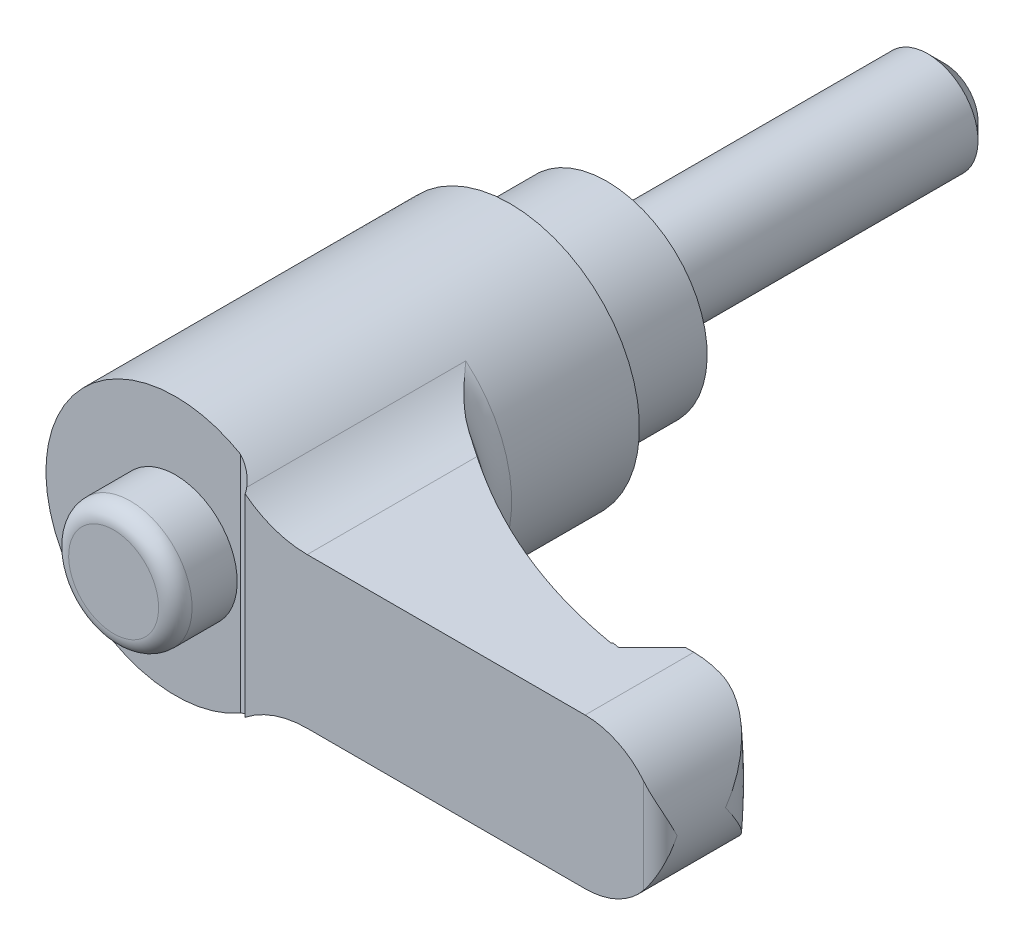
ISO-10303-21;
HEADER;
FILE_DESCRIPTION(('STEP AP214'),'2;1');
FILE_NAME('part.step','',(''),(''),'','','');
FILE_SCHEMA(('AUTOMOTIVE_DESIGN { 1 0 10303 214 1 1 1 1 }'));
ENDSEC;
DATA;
#1=APPLICATION_CONTEXT('core data for automotive mechanical design processes');
#2=APPLICATION_PROTOCOL_DEFINITION('international standard','automotive_design',2000,#1);
#3=PRODUCT_CONTEXT('',#1,'mechanical');
#4=PRODUCT('Part','Part','',(#3));
#5=PRODUCT_RELATED_PRODUCT_CATEGORY('part','',(#4));
#6=PRODUCT_DEFINITION_FORMATION('','',#4);
#7=PRODUCT_DEFINITION_CONTEXT('part definition',#1,'design');
#8=PRODUCT_DEFINITION('design','',#6,#7);
#9=PRODUCT_DEFINITION_SHAPE('','',#8);
#10=(LENGTH_UNIT() NAMED_UNIT(*) SI_UNIT(.MILLI.,.METRE.));
#11=(NAMED_UNIT(*) PLANE_ANGLE_UNIT() SI_UNIT($,.RADIAN.));
#12=(NAMED_UNIT(*) SI_UNIT($,.STERADIAN.) SOLID_ANGLE_UNIT());
#13=UNCERTAINTY_MEASURE_WITH_UNIT(LENGTH_MEASURE(1.E-05),#10,'distance_accuracy_value','');
#14=(GEOMETRIC_REPRESENTATION_CONTEXT(3) GLOBAL_UNCERTAINTY_ASSIGNED_CONTEXT((#13)) GLOBAL_UNIT_ASSIGNED_CONTEXT((#10,
#11,#12)) REPRESENTATION_CONTEXT('',''));
#15=CARTESIAN_POINT('',(0.,0.,0.));
#16=DIRECTION('',(0.,0.,1.));
#17=DIRECTION('',(1.,0.,0.));
#18=AXIS2_PLACEMENT_3D('',#15,#16,#17);
#19=CARTESIAN_POINT('',(4.8,0.,0.));
#20=DIRECTION('',(0.,0.,1.));
#21=DIRECTION('',(0.,-1.,0.));
#22=AXIS2_PLACEMENT_3D('',#19,#20,#21);
#23=PLANE('',#22);
#24=CARTESIAN_POINT('',(0.,0.,0.));
#25=DIRECTION('',(0.,0.,-1.));
#26=DIRECTION('',(0.,1.,0.));
#27=AXIS2_PLACEMENT_3D('',#24,#25,#26);
#28=CIRCLE('',#27,3.);
#29=CARTESIAN_POINT('',(0.,3.,0.));
#30=VERTEX_POINT('',#29);
#31=EDGE_CURVE('E493',#30,#30,#28,.T.);
#32=ORIENTED_EDGE('',*,*,#31,.F.);
#33=EDGE_LOOP('',(#32));
#34=FACE_BOUND('',#33,.T.);
#35=CARTESIAN_POINT('',(0.,0.,0.));
#36=DIRECTION('',(0.,0.,-1.));
#37=DIRECTION('',(0.,1.,0.));
#38=AXIS2_PLACEMENT_3D('',#35,#36,#37);
#39=CIRCLE('',#38,4.8);
#40=CARTESIAN_POINT('',(0.,4.8,0.));
#41=VERTEX_POINT('',#40);
#42=EDGE_CURVE('E433',#41,#41,#39,.T.);
#43=ORIENTED_EDGE('',*,*,#42,.T.);
#44=EDGE_LOOP('',(#43));
#45=FACE_BOUND('',#44,.T.);
#46=ADVANCED_FACE('F14',(#34,#45),#23,.F.);
#47=CARTESIAN_POINT('',(0.,0.,26.));
#48=DIRECTION('',(0.,0.,-1.));
#49=DIRECTION('',(0.,1.,0.));
#50=AXIS2_PLACEMENT_3D('',#47,#48,#49);
#51=PLANE('',#50);
#52=CARTESIAN_POINT('',(0.,0.,26.));
#53=DIRECTION('',(0.,0.,-1.));
#54=DIRECTION('',(0.,1.,0.));
#55=AXIS2_PLACEMENT_3D('',#52,#53,#54);
#56=CIRCLE('',#55,7.75);
#57=CARTESIAN_POINT('',(3.875,-6.7116968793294,26.));
#58=VERTEX_POINT('',#57);
#59=CARTESIAN_POINT('',(3.875,6.7116968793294,26.));
#60=VERTEX_POINT('',#59);
#61=EDGE_CURVE('E380',#58,#60,#56,.T.);
#62=ORIENTED_EDGE('',*,*,#61,.F.);
#63=DIRECTION('',(0.,1.,0.));
#64=VECTOR('',#63,1.);
#65=CARTESIAN_POINT('',(3.875,-9.,26.));
#66=LINE('',#65,#64);
#67=EDGE_CURVE('E467',#58,#60,#66,.T.);
#68=ORIENTED_EDGE('',*,*,#67,.T.);
#69=EDGE_LOOP('',(#62,#68));
#70=FACE_BOUND('',#69,.T.);
#71=CARTESIAN_POINT('',(0.,0.,26.));
#72=DIRECTION('',(0.,0.,-1.));
#73=DIRECTION('',(0.,1.,0.));
#74=AXIS2_PLACEMENT_3D('',#71,#72,#73);
#75=CIRCLE('',#74,3.69047619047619);
#76=CARTESIAN_POINT('',(0.,3.69047619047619,26.));
#77=VERTEX_POINT('',#76);
#78=EDGE_CURVE('E188',#77,#77,#75,.F.);
#79=ORIENTED_EDGE('',*,*,#78,.F.);
#80=EDGE_LOOP('',(#79));
#81=FACE_BOUND('',#80,.T.);
#82=ADVANCED_FACE('F163',(#70,#81),#51,.F.);
#83=CARTESIAN_POINT('',(25.5,0.,0.));
#84=DIRECTION('',(0.,0.,1.));
#85=DIRECTION('',(0.,-1.,0.));
#86=AXIS2_PLACEMENT_3D('',#83,#84,#85);
#87=CYLINDRICAL_SURFACE('',#86,4.5);
#88=CARTESIAN_POINT('',(30.,0.,23.1));
#89=CARTESIAN_POINT('',(30.0000000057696,-0.00397224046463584,23.0972162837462));
#90=CARTESIAN_POINT('',(29.9999947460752,-0.00794462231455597,23.0944324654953));
#91=CARTESIAN_POINT('',(29.9991779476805,-0.316207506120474,22.8784039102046));
#92=CARTESIAN_POINT('',(29.967472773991,-0.621260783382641,22.6646232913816));
#93=CARTESIAN_POINT('',(29.8729566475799,-1.07288244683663,22.3499400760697));
#94=CARTESIAN_POINT('',(29.8335087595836,-1.2227001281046,22.2458576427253));
#95=CARTESIAN_POINT('',(29.7386099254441,-1.51933949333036,22.0407893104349));
#96=CARTESIAN_POINT('',(29.6831664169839,-1.6661625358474,21.9398019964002));
#97=CARTESIAN_POINT('',(29.5225221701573,-2.0316181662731,21.690355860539));
#98=CARTESIAN_POINT('',(29.4064726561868,-2.24755940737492,21.5447545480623));
#99=CARTESIAN_POINT('',(29.1349908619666,-2.66429651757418,21.2699985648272));
#100=CARTESIAN_POINT('',(28.9796468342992,-2.86512503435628,21.1408080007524));
#101=CARTESIAN_POINT('',(28.6740094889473,-3.19567948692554,20.9378778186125));
#102=CARTESIAN_POINT('',(28.5328529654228,-3.3303385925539,20.8584463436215));
#103=CARTESIAN_POINT('',(28.2285136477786,-3.58389708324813,20.7186599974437));
#104=CARTESIAN_POINT('',(28.0653563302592,-3.70281438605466,20.6582833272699));
#105=CARTESIAN_POINT('',(27.7569268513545,-3.89637158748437,20.5739705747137));
#106=CARTESIAN_POINT('',(27.6155988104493,-3.97499958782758,20.5449430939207));
#107=CARTESIAN_POINT('',(27.3962983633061,-4.08175109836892,20.516319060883));
#108=CARTESIAN_POINT('',(27.3219652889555,-4.11547521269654,20.5092639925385));
#109=CARTESIAN_POINT('',(27.1713145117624,-4.17892025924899,20.5006475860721));
#110=CARTESIAN_POINT('',(27.0949977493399,-4.20864304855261,20.4990836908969));
#111=CARTESIAN_POINT('',(26.940135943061,-4.26413478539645,20.5019689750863));
#112=CARTESIAN_POINT('',(26.8615759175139,-4.28985895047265,20.5064814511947));
#113=CARTESIAN_POINT('',(26.7037978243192,-4.33677756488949,20.5220962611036));
#114=CARTESIAN_POINT('',(26.624580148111,-4.35797453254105,20.5331949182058));
#115=CARTESIAN_POINT('',(26.4663684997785,-4.39576374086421,20.5623470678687));
#116=CARTESIAN_POINT('',(26.3873744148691,-4.41235899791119,20.5803959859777));
#117=CARTESIAN_POINT('',(26.230581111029,-4.44101436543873,20.6236628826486));
#118=CARTESIAN_POINT('',(26.1527814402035,-4.4530762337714,20.6488780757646));
#119=CARTESIAN_POINT('',(25.9747863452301,-4.47604389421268,20.7158088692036));
#120=CARTESIAN_POINT('',(25.8753706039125,-4.48535121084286,20.7602222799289));
#121=CARTESIAN_POINT('',(25.7308199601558,-4.4943380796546,20.836059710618));
#122=CARTESIAN_POINT('',(25.6833620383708,-4.49650441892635,20.8629005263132));
#123=CARTESIAN_POINT('',(25.5902043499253,-4.4993369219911,20.9195771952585));
#124=CARTESIAN_POINT('',(25.5445050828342,-4.50000266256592,20.9494138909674));
#125=CARTESIAN_POINT('',(25.4998,-4.49999999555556,20.980704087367));
#126=B_SPLINE_CURVE_WITH_KNOTS('',3,(#88,#89,#90,#91,#92,#93,#94,#95,#96,#97,#98,#99,#100,#101,
#102,#103,#104,#105,#106,#107,#108,#109,#110,#111,#112,#113,#114,#115,#116,#117,#118,#119,#120,
#121,#122,#123,#124,#125),.UNSPECIFIED.,.F.,.F.,(4,2,2,2,2,2,2,2,2,2,2,2,2,2,2,2,2,2,4),(0.,
0.0145521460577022,1.12923174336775,1.68863416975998,2.24777690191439,3.0999476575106,
3.95022123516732,4.58000022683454,5.20905610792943,5.69992949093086,5.94545977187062,
6.19087570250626,6.43886797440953,6.68672193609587,6.93441304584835,7.18200801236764,
7.50864895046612,7.67223429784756,7.83586577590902),.UNSPECIFIED.);
#127=CARTESIAN_POINT('',(27.0737254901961,-4.21584962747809,20.5));
#128=VERTEX_POINT('',#127);
#129=CARTESIAN_POINT('',(30.,0.,23.1));
#130=VERTEX_POINT('',#129);
#131=EDGE_CURVE('E133',#128,#130,#126,.F.);
#132=ORIENTED_EDGE('',*,*,#131,.T.);
#133=CARTESIAN_POINT('',(30.,0.,23.1));
#134=CARTESIAN_POINT('',(30.0000000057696,0.00397224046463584,23.0972162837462));
#135=CARTESIAN_POINT('',(29.9999947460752,0.00794462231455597,23.0944324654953));
#136=CARTESIAN_POINT('',(29.9991779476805,0.316207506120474,22.8784039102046));
#137=CARTESIAN_POINT('',(29.967472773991,0.621260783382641,22.6646232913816));
#138=CARTESIAN_POINT('',(29.8729566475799,1.07288244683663,22.3499400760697));
#139=CARTESIAN_POINT('',(29.8335087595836,1.2227001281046,22.2458576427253));
#140=CARTESIAN_POINT('',(29.7386099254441,1.51933949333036,22.0407893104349));
#141=CARTESIAN_POINT('',(29.6831664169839,1.6661625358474,21.9398019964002));
#142=CARTESIAN_POINT('',(29.5225221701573,2.0316181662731,21.690355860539));
#143=CARTESIAN_POINT('',(29.4064726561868,2.24755940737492,21.5447545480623));
#144=CARTESIAN_POINT('',(29.1349908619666,2.66429651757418,21.2699985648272));
#145=CARTESIAN_POINT('',(28.9796468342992,2.86512503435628,21.1408080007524));
#146=CARTESIAN_POINT('',(28.6740094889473,3.19567948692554,20.9378778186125));
#147=CARTESIAN_POINT('',(28.5328529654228,3.3303385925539,20.8584463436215));
#148=CARTESIAN_POINT('',(28.2285136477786,3.58389708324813,20.7186599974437));
#149=CARTESIAN_POINT('',(28.0653563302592,3.70281438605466,20.6582833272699));
#150=CARTESIAN_POINT('',(27.7569268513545,3.89637158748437,20.5739705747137));
#151=CARTESIAN_POINT('',(27.6155988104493,3.97499958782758,20.5449430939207));
#152=CARTESIAN_POINT('',(27.3962983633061,4.08175109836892,20.516319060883));
#153=CARTESIAN_POINT('',(27.3219652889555,4.11547521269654,20.5092639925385));
#154=CARTESIAN_POINT('',(27.1713145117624,4.17892025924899,20.5006475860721));
#155=CARTESIAN_POINT('',(27.0949977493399,4.20864304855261,20.4990836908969));
#156=CARTESIAN_POINT('',(26.940135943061,4.26413478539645,20.5019689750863));
#157=CARTESIAN_POINT('',(26.8615759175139,4.28985895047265,20.5064814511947));
#158=CARTESIAN_POINT('',(26.7037978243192,4.33677756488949,20.5220962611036));
#159=CARTESIAN_POINT('',(26.624580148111,4.35797453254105,20.5331949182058));
#160=CARTESIAN_POINT('',(26.4663684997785,4.39576374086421,20.5623470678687));
#161=CARTESIAN_POINT('',(26.3873744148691,4.41235899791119,20.5803959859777));
#162=CARTESIAN_POINT('',(26.230581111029,4.44101436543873,20.6236628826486));
#163=CARTESIAN_POINT('',(26.1527814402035,4.4530762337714,20.6488780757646));
#164=CARTESIAN_POINT('',(25.9747863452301,4.47604389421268,20.7158088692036));
#165=CARTESIAN_POINT('',(25.8753706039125,4.48535121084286,20.7602222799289));
#166=CARTESIAN_POINT('',(25.7308199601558,4.4943380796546,20.836059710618));
#167=CARTESIAN_POINT('',(25.6833620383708,4.49650441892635,20.8629005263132));
#168=CARTESIAN_POINT('',(25.5902043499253,4.4993369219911,20.9195771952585));
#169=CARTESIAN_POINT('',(25.5445050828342,4.50000266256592,20.9494138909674));
#170=CARTESIAN_POINT('',(25.4998,4.49999999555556,20.980704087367));
#171=B_SPLINE_CURVE_WITH_KNOTS('',3,(#133,#134,#135,#136,#137,#138,#139,#140,#141,#142,#143,
#144,#145,#146,#147,#148,#149,#150,#151,#152,#153,#154,#155,#156,#157,#158,#159,#160,#161,#162,
#163,#164,#165,#166,#167,#168,#169,#170),.UNSPECIFIED.,.F.,.F.,(4,2,2,2,2,2,2,2,2,2,2,2,2,2,2,2,
2,2,4),(0.,0.0145521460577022,1.12923174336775,1.68863416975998,2.24777690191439,
3.0999476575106,3.95022123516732,4.58000022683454,5.20905610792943,5.69992949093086,
5.94545977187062,6.19087570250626,6.43886797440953,6.68672193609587,6.93441304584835,
7.18200801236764,7.50864895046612,7.67223429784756,7.83586577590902),.UNSPECIFIED.);
#172=CARTESIAN_POINT('',(27.0737254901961,4.21584962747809,20.5));
#173=VERTEX_POINT('',#172);
#174=EDGE_CURVE('E130',#130,#173,#171,.T.);
#175=ORIENTED_EDGE('',*,*,#174,.T.);
#176=CARTESIAN_POINT('',(25.5,0.,20.5));
#177=DIRECTION('',(0.,0.,-1.));
#178=DIRECTION('',(0.,1.,0.));
#179=AXIS2_PLACEMENT_3D('',#176,#177,#178);
#180=CIRCLE('',#179,4.5);
#181=CARTESIAN_POINT('',(25.5,4.5,20.5));
#182=VERTEX_POINT('',#181);
#183=EDGE_CURVE('E405',#173,#182,#180,.F.);
#184=ORIENTED_EDGE('',*,*,#183,.T.);
#185=DIRECTION('',(0.,0.,1.));
#186=VECTOR('',#185,1.);
#187=CARTESIAN_POINT('',(25.5,4.5,0.));
#188=LINE('',#187,#186);
#189=CARTESIAN_POINT('',(25.5,4.5,27.));
#190=VERTEX_POINT('',#189);
#191=EDGE_CURVE('E404',#182,#190,#188,.T.);
#192=ORIENTED_EDGE('',*,*,#191,.T.);
#193=CARTESIAN_POINT('',(25.5,0.,27.));
#194=DIRECTION('',(0.,0.,1.));
#195=DIRECTION('',(0.,-1.,0.));
#196=AXIS2_PLACEMENT_3D('',#193,#194,#195);
#197=CIRCLE('',#196,4.5);
#198=CARTESIAN_POINT('',(29.,2.82842712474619,27.));
#199=VERTEX_POINT('',#198);
#200=EDGE_CURVE('E383',#199,#190,#197,.T.);
#201=ORIENTED_EDGE('',*,*,#200,.F.);
#202=CARTESIAN_POINT('',(29.,2.82842712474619,27.));
#203=CARTESIAN_POINT('',(29.0452569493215,2.77244060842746,26.9999705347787));
#204=CARTESIAN_POINT('',(29.08910814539,2.71541373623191,26.9969310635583));
#205=CARTESIAN_POINT('',(29.1737346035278,2.59976408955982,26.9857221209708));
#206=CARTESIAN_POINT('',(29.2145155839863,2.54114457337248,26.9775624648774));
#207=CARTESIAN_POINT('',(29.2926216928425,2.42301598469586,26.9570723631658));
#208=CARTESIAN_POINT('',(29.3299701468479,2.36351669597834,26.9447732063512));
#209=CARTESIAN_POINT('',(29.4015263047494,2.24343051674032,26.9166544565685));
#210=CARTESIAN_POINT('',(29.4357319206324,2.18284293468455,26.9008325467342));
#211=CARTESIAN_POINT('',(29.5205149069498,2.0242761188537,26.8558925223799));
#212=CARTESIAN_POINT('',(29.5686353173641,1.92562477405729,26.8244847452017));
#213=CARTESIAN_POINT('',(29.6569408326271,1.7267576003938,26.7560098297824));
#214=CARTESIAN_POINT('',(29.6971228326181,1.62654117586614,26.7189404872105));
#215=CARTESIAN_POINT('',(29.769924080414,1.42454335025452,26.6403878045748));
#216=CARTESIAN_POINT('',(29.8025090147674,1.32275698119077,26.5988856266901));
#217=CARTESIAN_POINT('',(29.8600923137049,1.1184186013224,26.5127603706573));
#218=CARTESIAN_POINT('',(29.8850925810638,1.0158667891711,26.4681380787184));
#219=CARTESIAN_POINT('',(29.9373931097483,0.763467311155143,26.3559210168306));
#220=CARTESIAN_POINT('',(29.9605764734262,0.613303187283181,26.2871011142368));
#221=CARTESIAN_POINT('',(29.9916507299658,0.312779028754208,26.1474204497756));
#222=CARTESIAN_POINT('',(29.999578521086,0.162420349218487,26.0765650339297));
#223=CARTESIAN_POINT('',(29.9999945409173,0.00809034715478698,26.0038138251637));
#224=CARTESIAN_POINT('',(29.999999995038,0.00404514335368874,26.0019068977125));
#225=CARTESIAN_POINT('',(30.,0.,26.));
#226=B_SPLINE_CURVE_WITH_KNOTS('',3,(#202,#203,#204,#205,#206,#207,#208,#209,#210,#211,#212,
#213,#214,#215,#216,#217,#218,#219,#220,#221,#222,#223,#224,#225),.UNSPECIFIED.,.F.,.F.,(4,2,2,
2,2,2,2,2,2,2,2,4),(0.,0.215782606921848,0.431152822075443,0.644930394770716,0.858848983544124,
1.20082332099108,1.5429311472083,1.88655545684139,2.23009348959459,2.7297347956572,
3.22816610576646,3.2415825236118),.UNSPECIFIED.);
#227=CARTESIAN_POINT('',(30.,0.,26.));
#228=VERTEX_POINT('',#227);
#229=EDGE_CURVE('E174',#228,#199,#226,.F.);
#230=ORIENTED_EDGE('',*,*,#229,.F.);
#231=CARTESIAN_POINT('',(29.,-2.82842712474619,27.));
#232=CARTESIAN_POINT('',(29.0452569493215,-2.77244060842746,26.9999705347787));
#233=CARTESIAN_POINT('',(29.08910814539,-2.71541373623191,26.9969310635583));
#234=CARTESIAN_POINT('',(29.1737346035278,-2.59976408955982,26.9857221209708));
#235=CARTESIAN_POINT('',(29.2145155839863,-2.54114457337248,26.9775624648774));
#236=CARTESIAN_POINT('',(29.2926216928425,-2.42301598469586,26.9570723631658));
#237=CARTESIAN_POINT('',(29.3299701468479,-2.36351669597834,26.9447732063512));
#238=CARTESIAN_POINT('',(29.4015263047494,-2.24343051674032,26.9166544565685));
#239=CARTESIAN_POINT('',(29.4357319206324,-2.18284293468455,26.9008325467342));
#240=CARTESIAN_POINT('',(29.5205149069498,-2.0242761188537,26.8558925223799));
#241=CARTESIAN_POINT('',(29.5686353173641,-1.92562477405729,26.8244847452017));
#242=CARTESIAN_POINT('',(29.6569408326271,-1.7267576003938,26.7560098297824));
#243=CARTESIAN_POINT('',(29.6971228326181,-1.62654117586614,26.7189404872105));
#244=CARTESIAN_POINT('',(29.769924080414,-1.42454335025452,26.6403878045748));
#245=CARTESIAN_POINT('',(29.8025090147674,-1.32275698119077,26.5988856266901));
#246=CARTESIAN_POINT('',(29.8600923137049,-1.1184186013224,26.5127603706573));
#247=CARTESIAN_POINT('',(29.8850925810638,-1.0158667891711,26.4681380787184));
#248=CARTESIAN_POINT('',(29.9373931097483,-0.763467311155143,26.3559210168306));
#249=CARTESIAN_POINT('',(29.9605764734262,-0.613303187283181,26.2871011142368));
#250=CARTESIAN_POINT('',(29.9916507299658,-0.312779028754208,26.1474204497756));
#251=CARTESIAN_POINT('',(29.999578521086,-0.162420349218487,26.0765650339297));
#252=CARTESIAN_POINT('',(29.9999945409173,-0.00809034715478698,26.0038138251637));
#253=CARTESIAN_POINT('',(29.999999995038,-0.00404514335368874,26.0019068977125));
#254=CARTESIAN_POINT('',(30.,0.,26.));
#255=B_SPLINE_CURVE_WITH_KNOTS('',3,(#231,#232,#233,#234,#235,#236,#237,#238,#239,#240,#241,
#242,#243,#244,#245,#246,#247,#248,#249,#250,#251,#252,#253,#254),.UNSPECIFIED.,.F.,.F.,(4,2,2,
2,2,2,2,2,2,2,2,4),(0.,0.215782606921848,0.431152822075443,0.644930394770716,0.858848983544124,
1.20082332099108,1.5429311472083,1.88655545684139,2.23009348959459,2.7297347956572,
3.22816610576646,3.2415825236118),.UNSPECIFIED.);
#256=CARTESIAN_POINT('',(29.,-2.82842712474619,27.));
#257=VERTEX_POINT('',#256);
#258=EDGE_CURVE('E182',#257,#228,#255,.T.);
#259=ORIENTED_EDGE('',*,*,#258,.F.);
#260=CARTESIAN_POINT('',(25.5,-4.5,27.));
#261=VERTEX_POINT('',#260);
#262=EDGE_CURVE('E389',#261,#257,#197,.T.);
#263=ORIENTED_EDGE('',*,*,#262,.F.);
#264=DIRECTION('',(0.,0.,1.));
#265=VECTOR('',#264,1.);
#266=CARTESIAN_POINT('',(25.5,-4.5,0.));
#267=LINE('',#266,#265);
#268=CARTESIAN_POINT('',(25.5,-4.5,20.5));
#269=VERTEX_POINT('',#268);
#270=EDGE_CURVE('E409',#269,#261,#267,.T.);
#271=ORIENTED_EDGE('',*,*,#270,.F.);
#272=EDGE_CURVE('E140',#269,#128,#180,.F.);
#273=ORIENTED_EDGE('',*,*,#272,.T.);
#274=EDGE_LOOP('',(#132,#175,#184,#192,#201,#230,#259,#263,#271,#273));
#275=FACE_BOUND('',#274,.T.);
#276=ADVANCED_FACE('F138',(#275),#87,.T.);
#277=CARTESIAN_POINT('',(28.072410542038,-9.,-7.06806810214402));
#278=DIRECTION('',(0.,1.,0.));
#279=DIRECTION('',(-1.,0.,0.));
#280=AXIS2_PLACEMENT_3D('',#277,#278,#279);
#281=CYLINDRICAL_SURFACE('',#280,30.);
#282=CARTESIAN_POINT('',(22.457864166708,5.40076351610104,22.4018635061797));
#283=CARTESIAN_POINT('',(22.5328704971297,5.02783315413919,22.4161416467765));
#284=CARTESIAN_POINT('',(22.6003478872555,4.65331694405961,22.4287120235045));
#285=CARTESIAN_POINT('',(22.7199001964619,3.90172149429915,22.4506465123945));
#286=CARTESIAN_POINT('',(22.7719742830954,3.52464211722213,22.4600104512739));
#287=CARTESIAN_POINT('',(22.860391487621,2.76836181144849,22.4757441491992));
#288=CARTESIAN_POINT('',(22.8967259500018,2.38915983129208,22.4821122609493));
#289=CARTESIAN_POINT('',(22.953399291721,1.62955869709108,22.4919810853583));
#290=CARTESIAN_POINT('',(22.9737386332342,1.24915957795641,22.4954818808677));
#291=CARTESIAN_POINT('',(23.0101209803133,0.119914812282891,22.5017516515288));
#292=CARTESIAN_POINT('',(23.0030278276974,-0.62982701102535,22.5005458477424));
#293=CARTESIAN_POINT('',(22.9265280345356,-2.12549757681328,22.487326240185));
#294=CARTESIAN_POINT('',(22.8571649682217,-2.87142861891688,22.4753199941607));
#295=CARTESIAN_POINT('',(22.717445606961,-3.91200869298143,22.450161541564));
#296=CARTESIAN_POINT('',(22.6723784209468,-4.21035002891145,22.4419679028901));
#297=CARTESIAN_POINT('',(22.5724363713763,-4.80637536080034,22.4235048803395));
#298=CARTESIAN_POINT('',(22.5175283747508,-5.10405358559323,22.4132284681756));
#299=CARTESIAN_POINT('',(22.457864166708,-5.40076351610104,22.4018635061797));
#300=B_SPLINE_CURVE_WITH_KNOTS('',3,(#282,#283,#284,#285,#286,#287,#288,#289,#290,#291,#292,
#293,#294,#295,#296,#297,#298,#299),.UNSPECIFIED.,.F.,.F.,(4,2,2,2,2,2,2,2,4),(0.,
1.14192528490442,2.28391227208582,3.4265264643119,4.56910763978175,6.81558260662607,
9.06048679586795,9.96586555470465,10.8743519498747),.UNSPECIFIED.);
#301=CARTESIAN_POINT('',(23.,0.,22.5));
#302=VERTEX_POINT('',#301);
#303=CARTESIAN_POINT('',(22.6238084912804,-4.5,22.4329951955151));
#304=VERTEX_POINT('',#303);
#305=EDGE_CURVE('E136',#302,#304,#300,.T.);
#306=ORIENTED_EDGE('',*,*,#305,.F.);
#307=DIRECTION('',(0.,1.,0.));
#308=VECTOR('',#307,1.);
#309=CARTESIAN_POINT('',(23.,-9.,22.5));
#310=LINE('',#309,#308);
#311=CARTESIAN_POINT('',(23.,-4.5,22.5));
#312=VERTEX_POINT('',#311);
#313=EDGE_CURVE('E473',#312,#302,#310,.T.);
#314=ORIENTED_EDGE('',*,*,#313,.F.);
#315=CARTESIAN_POINT('',(28.072410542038,-4.5,-7.06806810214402));
#316=DIRECTION('',(0.,1.,0.));
#317=DIRECTION('',(-1.,0.,0.));
#318=AXIS2_PLACEMENT_3D('',#315,#316,#317);
#319=CIRCLE('',#318,30.);
#320=EDGE_CURVE('E464',#312,#304,#319,.F.);
#321=ORIENTED_EDGE('',*,*,#320,.T.);
#322=EDGE_LOOP('',(#306,#314,#321));
#323=FACE_BOUND('',#322,.T.);
#324=ADVANCED_FACE('F162',(#323),#281,.F.);
#325=CARTESIAN_POINT('',(27.4,-9.,20.5));
#326=DIRECTION('',(0.,0.,-1.));
#327=DIRECTION('',(0.,1.,0.));
#328=AXIS2_PLACEMENT_3D('',#325,#326,#327);
#329=PLANE('',#328);
#330=ORIENTED_EDGE('',*,*,#183,.F.);
#331=CARTESIAN_POINT('',(0.,0.,20.5));
#332=DIRECTION('',(0.,0.,-1.));
#333=DIRECTION('',(0.,1.,0.));
#334=AXIS2_PLACEMENT_3D('',#331,#332,#333);
#335=CIRCLE('',#334,27.4);
#336=EDGE_CURVE('E37',#173,#128,#335,.T.);
#337=ORIENTED_EDGE('',*,*,#336,.T.);
#338=ORIENTED_EDGE('',*,*,#272,.F.);
#339=DIRECTION('',(-1.,0.,0.));
#340=VECTOR('',#339,1.);
#341=CARTESIAN_POINT('',(25.5,-4.5,20.5));
#342=LINE('',#341,#340);
#343=CARTESIAN_POINT('',(25.,-4.5,20.5));
#344=VERTEX_POINT('',#343);
#345=EDGE_CURVE('E540',#269,#344,#342,.T.);
#346=ORIENTED_EDGE('',*,*,#345,.T.);
#347=DIRECTION('',(0.,1.,0.));
#348=VECTOR('',#347,1.);
#349=CARTESIAN_POINT('',(25.,-9.,20.5));
#350=LINE('',#349,#348);
#351=CARTESIAN_POINT('',(25.,4.5,20.5));
#352=VERTEX_POINT('',#351);
#353=EDGE_CURVE('E460',#344,#352,#350,.T.);
#354=ORIENTED_EDGE('',*,*,#353,.T.);
#355=DIRECTION('',(1.,0.,0.));
#356=VECTOR('',#355,1.);
#357=CARTESIAN_POINT('',(8.87764045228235,4.5,20.5));
#358=LINE('',#357,#356);
#359=EDGE_CURVE('E419',#352,#182,#358,.T.);
#360=ORIENTED_EDGE('',*,*,#359,.T.);
#361=EDGE_LOOP('',(#330,#337,#338,#346,#354,#360));
#362=FACE_BOUND('',#361,.T.);
#363=ADVANCED_FACE('F196',(#362),#329,.T.);
#364=CARTESIAN_POINT('',(0.,0.,27.));
#365=DIRECTION('',(0.,0.,1.));
#366=DIRECTION('',(0.,-1.,0.));
#367=AXIS2_PLACEMENT_3D('',#364,#365,#366);
#368=PLANE('',#367);
#369=CARTESIAN_POINT('',(8.87764045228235,10.5,27.));
#370=DIRECTION('',(0.,0.,1.));
#371=DIRECTION('',(1.,0.,0.));
#372=AXIS2_PLACEMENT_3D('',#369,#370,#371);
#373=CIRCLE('',#372,6.);
#374=CARTESIAN_POINT('',(5.16666666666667,5.78527057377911,27.));
#375=VERTEX_POINT('',#374);
#376=CARTESIAN_POINT('',(8.87764045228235,4.5,27.));
#377=VERTEX_POINT('',#376);
#378=EDGE_CURVE('E414',#375,#377,#373,.T.);
#379=ORIENTED_EDGE('',*,*,#378,.F.);
#380=DIRECTION('',(0.,1.,0.));
#381=VECTOR('',#380,1.);
#382=CARTESIAN_POINT('',(5.16666666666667,-9.,27.));
#383=LINE('',#382,#381);
#384=CARTESIAN_POINT('',(5.16666666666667,-5.78527057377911,27.));
#385=VERTEX_POINT('',#384);
#386=EDGE_CURVE('E453',#385,#375,#383,.T.);
#387=ORIENTED_EDGE('',*,*,#386,.F.);
#388=CARTESIAN_POINT('',(8.87764045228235,-10.5,27.));
#389=DIRECTION('',(0.,0.,1.));
#390=DIRECTION('',(1.,0.,0.));
#391=AXIS2_PLACEMENT_3D('',#388,#389,#390);
#392=CIRCLE('',#391,6.);
#393=CARTESIAN_POINT('',(8.87764045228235,-4.5,27.));
#394=VERTEX_POINT('',#393);
#395=EDGE_CURVE('E417',#394,#385,#392,.T.);
#396=ORIENTED_EDGE('',*,*,#395,.F.);
#397=DIRECTION('',(-1.,0.,0.));
#398=VECTOR('',#397,1.);
#399=CARTESIAN_POINT('',(25.5,-4.5,27.));
#400=LINE('',#399,#398);
#401=EDGE_CURVE('E413',#261,#394,#400,.T.);
#402=ORIENTED_EDGE('',*,*,#401,.F.);
#403=ORIENTED_EDGE('',*,*,#262,.T.);
#404=DIRECTION('',(0.,1.,0.));
#405=VECTOR('',#404,1.);
#406=CARTESIAN_POINT('',(29.,-9.,27.));
#407=LINE('',#406,#405);
#408=EDGE_CURVE('E401',#257,#199,#407,.T.);
#409=ORIENTED_EDGE('',*,*,#408,.T.);
#410=ORIENTED_EDGE('',*,*,#200,.T.);
#411=DIRECTION('',(1.,0.,0.));
#412=VECTOR('',#411,1.);
#413=CARTESIAN_POINT('',(8.87764045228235,4.5,27.));
#414=LINE('',#413,#412);
#415=EDGE_CURVE('E400',#377,#190,#414,.T.);
#416=ORIENTED_EDGE('',*,*,#415,.F.);
#417=EDGE_LOOP('',(#379,#387,#396,#402,#403,#409,#410,#416));
#418=FACE_BOUND('',#417,.T.);
#419=ADVANCED_FACE('F244',(#418),#368,.T.);
#420=CARTESIAN_POINT('',(0.,0.,0.));
#421=DIRECTION('',(0.,0.,-1.));
#422=DIRECTION('',(0.,1.,0.));
#423=AXIS2_PLACEMENT_3D('',#420,#421,#422);
#424=CYLINDRICAL_SURFACE('',#423,7.75);
#425=CARTESIAN_POINT('',(0.,0.,13.6426560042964));
#426=DIRECTION('',(0.,0.,-1.));
#427=DIRECTION('',(0.,1.,0.));
#428=AXIS2_PLACEMENT_3D('',#425,#426,#427);
#429=CIRCLE('',#428,7.75);
#430=CARTESIAN_POINT('',(5.00376098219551,5.91818181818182,13.6426560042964));
#431=VERTEX_POINT('',#430);
#432=CARTESIAN_POINT('',(5.00376098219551,-5.91818181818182,13.6426560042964));
#433=VERTEX_POINT('',#432);
#434=EDGE_CURVE('E374',#431,#433,#429,.T.);
#435=ORIENTED_EDGE('',*,*,#434,.T.);
#436=DIRECTION('',(0.,0.,1.));
#437=VECTOR('',#436,1.);
#438=CARTESIAN_POINT('',(5.00376098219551,-5.91818181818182,0.));
#439=LINE('',#438,#437);
#440=CARTESIAN_POINT('',(5.00376098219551,-5.91818181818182,26.7442638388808));
#441=VERTEX_POINT('',#440);
#442=EDGE_CURVE('E425',#433,#441,#439,.T.);
#443=ORIENTED_EDGE('',*,*,#442,.T.);
#444=CARTESIAN_POINT('',(3.875,-6.7116968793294,26.));
#445=CARTESIAN_POINT('',(3.9487248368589,-6.66914880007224,26.0179048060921));
#446=CARTESIAN_POINT('',(4.02097408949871,-6.62579988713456,26.039874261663));
#447=CARTESIAN_POINT('',(4.16199829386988,-6.53812669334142,26.0915573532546));
#448=CARTESIAN_POINT('',(4.23077434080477,-6.49380272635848,26.1212685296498));
#449=CARTESIAN_POINT('',(4.36202505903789,-6.40634475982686,26.1868862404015));
#450=CARTESIAN_POINT('',(4.42463632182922,-6.36322379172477,26.2225378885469));
#451=CARTESIAN_POINT('',(4.54579687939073,-6.27724013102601,26.3004737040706));
#452=CARTESIAN_POINT('',(4.60434578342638,-6.23437746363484,26.3427585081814));
#453=CARTESIAN_POINT('',(4.71026264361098,-6.1546555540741,26.4283893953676));
#454=CARTESIAN_POINT('',(4.75813291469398,-6.11768751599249,26.4710140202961));
#455=CARTESIAN_POINT('',(4.8500303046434,-6.04509175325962,26.56120031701));
#456=CARTESIAN_POINT('',(4.89405965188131,-6.00946325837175,26.6087590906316));
#457=CARTESIAN_POINT('',(4.97925799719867,-5.9390764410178,26.7103994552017));
#458=CARTESIAN_POINT('',(5.02029084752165,-5.90438218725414,26.7646407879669));
#459=CARTESIAN_POINT('',(5.09738332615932,-5.83796295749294,26.8783962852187));
#460=CARTESIAN_POINT('',(5.13343386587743,-5.80624344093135,26.9379197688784));
#461=CARTESIAN_POINT('',(5.16666666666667,-5.77650894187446,27.));
#462=B_SPLINE_CURVE_WITH_KNOTS('',3,(#444,#445,#446,#447,#448,#449,#450,#451,#452,#453,#454,
#455,#456,#457,#458,#459,#460,#461),.UNSPECIFIED.,.F.,.F.,(4,2,2,2,2,2,2,2,4),(0.,
0.260811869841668,0.521540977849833,0.773092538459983,1.02466826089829,1.24638864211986,
1.4679795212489,1.69664297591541,1.92571819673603),.UNSPECIFIED.);
#463=EDGE_CURVE('E218',#58,#441,#462,.T.);
#464=ORIENTED_EDGE('',*,*,#463,.F.);
#465=ORIENTED_EDGE('',*,*,#61,.T.);
#466=CARTESIAN_POINT('',(5.16666666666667,5.77650894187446,27.));
#467=CARTESIAN_POINT('',(5.13714077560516,5.80292379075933,26.9448365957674));
#468=CARTESIAN_POINT('',(5.1053831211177,5.83091583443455,26.8916890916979));
#469=CARTESIAN_POINT('',(5.03785941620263,5.88934998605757,26.7895453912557));
#470=CARTESIAN_POINT('',(5.00209830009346,5.91978906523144,26.7405442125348));
#471=CARTESIAN_POINT('',(4.92700880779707,5.98243056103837,26.646752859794));
#472=CARTESIAN_POINT('',(4.88768622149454,6.01463008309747,26.6019560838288));
#473=CARTESIAN_POINT('',(4.80573825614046,6.08030777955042,26.5165060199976));
#474=CARTESIAN_POINT('',(4.76311181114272,6.11378636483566,26.4758540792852));
#475=CARTESIAN_POINT('',(4.63114473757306,6.21507952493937,26.3605779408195));
#476=CARTESIAN_POINT('',(4.53728284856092,6.28411879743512,26.2920994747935));
#477=CARTESIAN_POINT('',(4.3393749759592,6.42237347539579,26.1724069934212));
#478=CARTESIAN_POINT('',(4.23533663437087,6.49158871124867,26.1211801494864));
#479=CARTESIAN_POINT('',(4.08621326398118,6.5854168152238,26.0632790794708));
#480=CARTESIAN_POINT('',(4.04469277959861,6.61100425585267,26.0487072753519));
#481=CARTESIAN_POINT('',(3.96061680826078,6.66171281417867,26.0222973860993));
#482=CARTESIAN_POINT('',(3.91806319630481,6.68683464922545,26.0104547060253));
#483=CARTESIAN_POINT('',(3.8750000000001,6.7116968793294,26.));
#484=B_SPLINE_CURVE_WITH_KNOTS('',3,(#466,#467,#468,#469,#470,#471,#472,#473,#474,#475,#476,
#477,#478,#479,#480,#481,#482,#483),.UNSPECIFIED.,.F.,.F.,(4,2,2,2,2,2,2,2,4),(0.,
0.203583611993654,0.406919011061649,0.609929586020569,0.813005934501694,1.21684507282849,
1.62038324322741,1.77301957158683,1.9253970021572),.UNSPECIFIED.);
#485=CARTESIAN_POINT('',(5.0037609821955,5.91818181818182,26.7442638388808));
#486=VERTEX_POINT('',#485);
#487=EDGE_CURVE('E232',#486,#60,#484,.T.);
#488=ORIENTED_EDGE('',*,*,#487,.F.);
#489=DIRECTION('',(0.,0.,1.));
#490=VECTOR('',#489,1.);
#491=CARTESIAN_POINT('',(5.00376098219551,5.91818181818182,0.));
#492=LINE('',#491,#490);
#493=EDGE_CURVE('E431',#431,#486,#492,.T.);
#494=ORIENTED_EDGE('',*,*,#493,.F.);
#495=EDGE_LOOP('',(#435,#443,#464,#465,#488,#494));
#496=FACE_BOUND('',#495,.T.);
#497=CARTESIAN_POINT('',(0.,0.,6.));
#498=DIRECTION('',(0.,0.,-1.));
#499=DIRECTION('',(0.,1.,0.));
#500=AXIS2_PLACEMENT_3D('',#497,#498,#499);
#501=CIRCLE('',#500,7.75);
#502=CARTESIAN_POINT('',(0.,7.75,6.));
#503=VERTEX_POINT('',#502);
#504=EDGE_CURVE('E378',#503,#503,#501,.T.);
#505=ORIENTED_EDGE('',*,*,#504,.F.);
#506=EDGE_LOOP('',(#505));
#507=FACE_BOUND('',#506,.T.);
#508=ADVANCED_FACE('F242',(#496,#507),#424,.T.);
#509=CARTESIAN_POINT('',(8.87764045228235,10.5,0.));
#510=DIRECTION('',(0.,0.,1.));
#511=DIRECTION('',(0.,-1.,0.));
#512=AXIS2_PLACEMENT_3D('',#509,#510,#511);
#513=CYLINDRICAL_SURFACE('',#512,6.);
#514=DIRECTION('',(0.,0.,1.));
#515=VECTOR('',#514,1.);
#516=CARTESIAN_POINT('',(8.87764045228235,4.5,0.));
#517=LINE('',#516,#515);
#518=CARTESIAN_POINT('',(8.87764045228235,4.5,16.8419191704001));
#519=VERTEX_POINT('',#518);
#520=EDGE_CURVE('E408',#519,#377,#517,.T.);
#521=ORIENTED_EDGE('',*,*,#520,.F.);
#522=CARTESIAN_POINT('',(8.87784045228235,4.50000000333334,16.8420543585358));
#523=CARTESIAN_POINT('',(8.76298675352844,4.50000678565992,16.7644412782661));
#524=CARTESIAN_POINT('',(8.64795886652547,4.50329006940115,16.687069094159));
#525=CARTESIAN_POINT('',(8.41786670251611,4.51653249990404,16.5336144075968));
#526=CARTESIAN_POINT('',(8.30280331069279,4.52647413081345,16.457529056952));
#527=CARTESIAN_POINT('',(8.07233993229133,4.55315590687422,16.3070362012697));
#528=CARTESIAN_POINT('',(7.95693991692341,4.56989665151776,16.2326288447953));
#529=CARTESIAN_POINT('',(7.72548993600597,4.61048878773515,16.0861329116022));
#530=CARTESIAN_POINT('',(7.60943905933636,4.63435875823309,16.0140509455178));
#531=CARTESIAN_POINT('',(7.49320434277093,4.66190641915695,15.9436475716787));
#532=B_SPLINE_CURVE_WITH_KNOTS('',3,(#522,#523,#524,#525,#526,#527,#528,#529,#530,#531),
.UNSPECIFIED.,.F.,.F.,(4,2,2,2,4),(0.,0.415830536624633,0.830571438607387,1.24534891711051,
1.66121688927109),.UNSPECIFIED.);
#533=CARTESIAN_POINT('',(7.49353468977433,4.66182809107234,15.9438475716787));
#534=VERTEX_POINT('',#533);
#535=EDGE_CURVE('E258',#519,#534,#532,.T.);
#536=ORIENTED_EDGE('',*,*,#535,.T.);
#537=CARTESIAN_POINT('',(7.49386505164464,4.66174977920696,15.9440475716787));
#538=CARTESIAN_POINT('',(7.41534599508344,4.68036361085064,15.8965108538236));
#539=CARTESIAN_POINT('',(7.33813459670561,4.70033346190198,15.8474028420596));
#540=CARTESIAN_POINT('',(7.18628313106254,4.74278447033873,15.7464454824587));
#541=CARTESIAN_POINT('',(7.11164195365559,4.76526452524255,15.694597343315));
#542=CARTESIAN_POINT('',(6.89171782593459,4.83609524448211,15.5357042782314));
#543=CARTESIAN_POINT('',(6.75010221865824,4.88791699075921,15.4251060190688));
#544=CARTESIAN_POINT('',(6.47674906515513,4.99932791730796,15.1976148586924));
#545=CARTESIAN_POINT('',(6.34496293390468,5.05887426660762,15.0807586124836));
#546=CARTESIAN_POINT('',(6.08952700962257,5.18523508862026,14.8421034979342));
#547=CARTESIAN_POINT('',(5.96588083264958,5.25205275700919,14.7203024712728));
#548=CARTESIAN_POINT('',(5.6959472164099,5.41010140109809,14.4425118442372));
#549=CARTESIAN_POINT('',(5.55174299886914,5.50325599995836,14.2855983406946));
#550=CARTESIAN_POINT('',(5.27355500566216,5.70004368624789,13.9693256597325));
#551=CARTESIAN_POINT('',(5.13957057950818,5.80367610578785,13.8099666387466));
#552=CARTESIAN_POINT('',(5.00807252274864,5.91453907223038,13.6479722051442));
#553=CARTESIAN_POINT('',(5.00591610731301,5.91635969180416,13.6453140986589));
#554=CARTESIAN_POINT('',(5.00376098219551,5.91818181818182,13.6426560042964));
#555=B_SPLINE_CURVE_WITH_KNOTS('',3,(#537,#538,#539,#540,#541,#542,#543,#544,#545,#546,#547,
#548,#549,#550,#551,#552,#553,#554),.UNSPECIFIED.,.F.,.F.,(4,2,2,2,2,2,2,2,4),(0.,
0.280888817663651,0.561654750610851,1.12199628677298,1.67935400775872,2.2369576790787,
2.93418472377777,3.63136735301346,3.6429980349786),.UNSPECIFIED.);
#556=EDGE_CURVE('E249',#534,#431,#555,.T.);
#557=ORIENTED_EDGE('',*,*,#556,.T.);
#558=ORIENTED_EDGE('',*,*,#493,.T.);
#559=CARTESIAN_POINT('',(5.16666666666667,5.78527057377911,27.));
#560=CARTESIAN_POINT('',(5.1544362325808,5.79489712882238,26.9771411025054));
#561=CARTESIAN_POINT('',(5.14182657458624,5.80489933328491,26.9546446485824));
#562=CARTESIAN_POINT('',(5.11593353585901,5.82561925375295,26.910451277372));
#563=CARTESIAN_POINT('',(5.10265156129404,5.83633549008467,26.8887528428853));
#564=CARTESIAN_POINT('',(5.07544919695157,5.85848632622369,26.8461383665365));
#565=CARTESIAN_POINT('',(5.06152881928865,5.86992091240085,26.8252223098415));
#566=CARTESIAN_POINT('',(5.03308032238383,5.89351543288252,26.784152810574));
#567=CARTESIAN_POINT('',(5.0185510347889,5.90567678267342,26.7640009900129));
#568=CARTESIAN_POINT('',(5.0037609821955,5.91818181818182,26.7442638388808));
#569=B_SPLINE_CURVE_WITH_KNOTS('',3,(#559,#560,#561,#562,#563,#564,#565,#566,#567,#568),
.UNSPECIFIED.,.F.,.F.,(4,2,2,2,4),(0.,0.0829550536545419,0.165743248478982,0.248529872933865,
0.331483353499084),.UNSPECIFIED.);
#570=EDGE_CURVE('E226',#375,#486,#569,.T.);
#571=ORIENTED_EDGE('',*,*,#570,.F.);
#572=ORIENTED_EDGE('',*,*,#378,.T.);
#573=EDGE_LOOP('',(#521,#536,#557,#558,#571,#572));
#574=FACE_BOUND('',#573,.T.);
#575=ADVANCED_FACE('F238',(#574),#513,.F.);
#576=CARTESIAN_POINT('',(8.87764045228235,4.5,0.));
#577=DIRECTION('',(0.,-1.,0.));
#578=DIRECTION('',(1.,0.,0.));
#579=AXIS2_PLACEMENT_3D('',#576,#577,#578);
#580=PLANE('',#579);
#581=CARTESIAN_POINT('',(28.072410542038,4.5,-7.06806810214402));
#582=DIRECTION('',(0.,-1.,0.));
#583=DIRECTION('',(1.,0.,0.));
#584=AXIS2_PLACEMENT_3D('',#581,#582,#583);
#585=CIRCLE('',#584,30.);
#586=CARTESIAN_POINT('',(22.6238084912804,4.5,22.432995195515));
#587=VERTEX_POINT('',#586);
#588=CARTESIAN_POINT('',(23.,4.5,22.5));
#589=VERTEX_POINT('',#588);
#590=EDGE_CURVE('E461',#587,#589,#585,.F.);
#591=ORIENTED_EDGE('',*,*,#590,.F.);
#592=CARTESIAN_POINT('',(44.3300735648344,4.5,0.942111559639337));
#593=CARTESIAN_POINT('',(43.4547012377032,4.5,1.81300466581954));
#594=CARTESIAN_POINT('',(42.5792011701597,4.5,2.68376940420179));
#595=CARTESIAN_POINT('',(40.8278840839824,4.5,4.42498033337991));
#596=CARTESIAN_POINT('',(39.9520670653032,4.5,5.29542652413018));
#597=CARTESIAN_POINT('',(37.3240501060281,4.5,7.90619283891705));
#598=CARTESIAN_POINT('',(35.5712829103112,4.5,9.64594205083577));
#599=CARTESIAN_POINT('',(32.0635642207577,4.5,13.1230346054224));
#600=CARTESIAN_POINT('',(30.3086128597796,4.5,14.8603780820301));
#601=CARTESIAN_POINT('',(27.6733297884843,4.5,17.4635089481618));
#602=CARTESIAN_POINT('',(26.7944244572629,4.5,18.3307401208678));
#603=CARTESIAN_POINT('',(25.0353323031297,4.5,20.0639019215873));
#604=CARTESIAN_POINT('',(24.155145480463,4.5,20.9298325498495));
#605=CARTESIAN_POINT('',(22.3129521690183,4.5,22.7385304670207));
#606=CARTESIAN_POINT('',(21.3507796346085,4.5,23.6811286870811));
#607=CARTESIAN_POINT('',(19.4234130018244,4.5,25.5632155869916));
#608=CARTESIAN_POINT('',(18.4582189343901,4.5,26.5027042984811));
#609=CARTESIAN_POINT('',(17.0068469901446,4.5,27.9082821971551));
#610=CARTESIAN_POINT('',(16.5224491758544,4.5,28.3762088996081));
#611=CARTESIAN_POINT('',(15.5521170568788,4.5,29.3104634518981));
#612=CARTESIAN_POINT('',(15.0661827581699,4.5,29.7767913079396));
#613=CARTESIAN_POINT('',(14.0922926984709,4.5,30.7073654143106));
#614=CARTESIAN_POINT('',(13.6043368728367,4.5,31.1716115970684));
#615=CARTESIAN_POINT('',(12.8703741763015,4.5,31.8658425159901));
#616=CARTESIAN_POINT('',(12.625380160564,4.5,32.0968979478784));
#617=CARTESIAN_POINT('',(12.1345901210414,4.5,32.5581570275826));
#618=CARTESIAN_POINT('',(11.8887940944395,4.5,32.7883606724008));
#619=CARTESIAN_POINT('',(11.6425345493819,4.5,33.0180686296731));
#620=B_SPLINE_CURVE_WITH_KNOTS('',3,(#592,#593,#594,#595,#596,#597,#598,#599,#600,#601,#602,
#603,#604,#605,#606,#607,#608,#609,#610,#611,#612,#613,#614,#615,#616,#617,#618,#619),
.UNSPECIFIED.,.F.,.F.,(4,2,2,2,2,2,2,2,2,2,2,2,2,4),(0.,3.70440058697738,7.40880170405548,
14.8175982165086,22.225964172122,25.9301609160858,29.6343569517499,33.6751954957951,
37.7159927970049,39.736477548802,41.7569544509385,43.7774964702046,44.7877808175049,
45.7980687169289),.UNSPECIFIED.);
#621=CARTESIAN_POINT('',(22.55548713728,4.5,22.5));
#622=VERTEX_POINT('',#621);
#623=EDGE_CURVE('E304',#587,#622,#620,.T.);
#624=ORIENTED_EDGE('',*,*,#623,.T.);
#625=CARTESIAN_POINT('',(15.4388208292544,4.5,20.4312501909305));
#626=CARTESIAN_POINT('',(14.9382009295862,4.5,20.2216724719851));
#627=CARTESIAN_POINT('',(14.4426076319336,4.5,19.9999912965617));
#628=CARTESIAN_POINT('',(13.4622769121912,4.5,19.5336725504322));
#629=CARTESIAN_POINT('',(12.9775414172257,4.5,19.2890309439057));
#630=CARTESIAN_POINT('',(12.0194633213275,4.5,18.778303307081));
#631=CARTESIAN_POINT('',(11.5461217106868,4.5,18.5122154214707));
#632=CARTESIAN_POINT('',(10.6110367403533,4.5,17.9604954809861));
#633=CARTESIAN_POINT('',(10.1492927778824,4.5,17.6748644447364));
#634=CARTESIAN_POINT('',(9.23133715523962,4.5,17.0827723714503));
#635=CARTESIAN_POINT('',(8.77526312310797,4.5,16.776098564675));
#636=CARTESIAN_POINT('',(8.09865121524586,4.5,16.3053789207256));
#637=CARTESIAN_POINT('',(7.87435773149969,4.5,16.1466830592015));
#638=CARTESIAN_POINT('',(7.42793360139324,4.5,15.826278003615));
#639=CARTESIAN_POINT('',(7.20580294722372,4.5,15.6645688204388));
#640=CARTESIAN_POINT('',(6.76333109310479,4.5,15.3388557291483));
#641=CARTESIAN_POINT('',(6.54298941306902,4.5,15.1748524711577));
#642=CARTESIAN_POINT('',(6.10341304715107,4.5,14.8453678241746));
#643=CARTESIAN_POINT('',(5.88417837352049,4.5,14.6798864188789));
#644=CARTESIAN_POINT('',(5.44597621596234,4.5,14.3486019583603));
#645=CARTESIAN_POINT('',(5.22700871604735,4.5,14.1827989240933));
#646=CARTESIAN_POINT('',(4.7881475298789,4.5,13.8524268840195));
#647=CARTESIAN_POINT('',(4.56825387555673,4.5,13.6878578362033));
#648=CARTESIAN_POINT('',(4.22599707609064,4.5,13.4359606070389));
#649=CARTESIAN_POINT('',(4.10454867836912,4.5,13.3473935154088));
#650=CARTESIAN_POINT('',(3.86050375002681,4.5,13.1718439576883));
#651=CARTESIAN_POINT('',(3.73790719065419,4.5,13.0848615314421));
#652=CARTESIAN_POINT('',(3.49095051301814,4.5,12.9129975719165));
#653=CARTESIAN_POINT('',(3.36658787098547,4.5,12.8281196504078));
#654=CARTESIAN_POINT('',(3.11579592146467,4.5,12.661467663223));
#655=CARTESIAN_POINT('',(2.98936669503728,4.5,12.5796934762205));
#656=CARTESIAN_POINT('',(2.73559541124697,4.5,12.421447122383));
#657=CARTESIAN_POINT('',(2.60828909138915,4.5,12.3449180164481));
#658=CARTESIAN_POINT('',(2.35045679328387,4.5,12.1973627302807));
#659=CARTESIAN_POINT('',(2.21993005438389,4.5,12.1263378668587));
#660=CARTESIAN_POINT('',(1.95547938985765,4.5,11.9918684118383));
#661=CARTESIAN_POINT('',(1.82156674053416,4.5,11.9284018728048));
#662=CARTESIAN_POINT('',(1.54956725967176,4.5,11.811188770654));
#663=CARTESIAN_POINT('',(1.41148300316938,4.5,11.7574363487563));
#664=CARTESIAN_POINT('',(1.16760292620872,4.5,11.6748301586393));
#665=CARTESIAN_POINT('',(1.06277320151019,4.5,11.6431384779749));
#666=CARTESIAN_POINT('',(0.850970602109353,4.5,11.5877982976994));
#667=CARTESIAN_POINT('',(0.743997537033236,4.5,11.5641505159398));
#668=CARTESIAN_POINT('',(0.528623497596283,4.5,11.5260430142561));
#669=CARTESIAN_POINT('',(0.420225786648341,4.5,11.5115651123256));
#670=CARTESIAN_POINT('',(0.202558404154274,4.5,11.4925018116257));
#671=CARTESIAN_POINT('',(0.0932888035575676,4.5,11.4879156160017));
#672=CARTESIAN_POINT('',(-0.125523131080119,4.5,11.4889012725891));
#673=CARTESIAN_POINT('',(-0.235065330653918,4.5,11.494502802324));
#674=CARTESIAN_POINT('',(-0.453184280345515,4.5,11.5155971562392));
#675=CARTESIAN_POINT('',(-0.561760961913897,4.5,11.5310906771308));
#676=CARTESIAN_POINT('',(-0.777434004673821,4.5,11.5711835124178));
#677=CARTESIAN_POINT('',(-0.884526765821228,4.5,11.5958019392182));
#678=CARTESIAN_POINT('',(-1.09652638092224,4.5,11.653010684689));
#679=CARTESIAN_POINT('',(-1.20143316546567,4.5,11.6856012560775));
#680=CARTESIAN_POINT('',(-1.54299128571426,4.5,11.8040046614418));
#681=CARTESIAN_POINT('',(-1.77469278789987,4.5,11.9041680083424));
#682=CARTESIAN_POINT('',(-2.11370642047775,4.5,12.0712278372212));
#683=CARTESIAN_POINT('',(-2.22542247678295,4.5,12.1298009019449));
#684=CARTESIAN_POINT('',(-2.4464125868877,4.5,12.2514053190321));
#685=CARTESIAN_POINT('',(-2.55568698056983,4.5,12.314436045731));
#686=CARTESIAN_POINT('',(-2.77325410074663,4.5,12.4446206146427));
#687=CARTESIAN_POINT('',(-2.88152520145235,4.5,12.5118101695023));
#688=CARTESIAN_POINT('',(-3.09631836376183,4.5,12.648928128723));
#689=CARTESIAN_POINT('',(-3.20284038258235,4.5,12.7188565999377));
#690=CARTESIAN_POINT('',(-3.41436916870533,4.5,12.8607497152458));
#691=CARTESIAN_POINT('',(-3.51937725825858,4.5,12.9327123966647));
#692=CARTESIAN_POINT('',(-3.72827441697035,4.5,13.0782322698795));
#693=CARTESIAN_POINT('',(-3.83216352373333,4.5,13.1517894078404));
#694=CARTESIAN_POINT('',(-4.05439859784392,4.5,13.3110694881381));
#695=CARTESIAN_POINT('',(-4.17260856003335,4.5,13.3969817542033));
#696=CARTESIAN_POINT('',(-4.4082339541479,4.5,13.5698902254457));
#697=CARTESIAN_POINT('',(-4.52564937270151,4.5,13.6568864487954));
#698=CARTESIAN_POINT('',(-4.87714945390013,4.5,13.9189069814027));
#699=CARTESIAN_POINT('',(-5.11047154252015,4.5,14.094951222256));
#700=CARTESIAN_POINT('',(-5.57685056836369,4.5,14.4474717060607));
#701=CARTESIAN_POINT('',(-5.80990745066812,4.5,14.6239480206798));
#702=CARTESIAN_POINT('',(-6.27690523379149,4.5,14.9757283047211));
#703=CARTESIAN_POINT('',(-6.51084612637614,4.5,15.1510322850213));
#704=CARTESIAN_POINT('',(-6.98047432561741,4.5,15.4993223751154));
#705=CARTESIAN_POINT('',(-7.21616173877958,4.5,15.6723083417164));
#706=CARTESIAN_POINT('',(-7.68986343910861,4.5,16.0150746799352));
#707=CARTESIAN_POINT('',(-7.92787774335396,4.5,16.1848550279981));
#708=CARTESIAN_POINT('',(-8.40663111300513,4.5,16.5205040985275));
#709=CARTESIAN_POINT('',(-8.64736999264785,4.5,16.6863730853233));
#710=CARTESIAN_POINT('',(-9.13186171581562,4.5,17.0136492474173));
#711=CARTESIAN_POINT('',(-9.37561458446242,4.5,17.1750563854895));
#712=CARTESIAN_POINT('',(-10.1060893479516,4.5,17.6482368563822));
#713=CARTESIAN_POINT('',(-10.5975021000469,4.5,17.952835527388));
#714=CARTESIAN_POINT('',(-11.5934664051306,4.5,18.5398125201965));
#715=CARTESIAN_POINT('',(-12.0980184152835,4.5,18.8221900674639));
#716=CARTESIAN_POINT('',(-13.1203636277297,4.5,19.362665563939));
#717=CARTESIAN_POINT('',(-13.6381640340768,4.5,19.6207499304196));
#718=CARTESIAN_POINT('',(-14.6860430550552,4.5,20.11066531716));
#719=CARTESIAN_POINT('',(-15.2161220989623,4.5,20.3424954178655));
#720=CARTESIAN_POINT('',(-16.5720374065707,4.5,20.8941289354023));
#721=CARTESIAN_POINT('',(-17.4055454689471,4.5,21.1953302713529));
#722=CARTESIAN_POINT('',(-19.0940463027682,4.5,21.7283556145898));
#723=CARTESIAN_POINT('',(-19.9490297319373,4.5,21.960209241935));
#724=CARTESIAN_POINT('',(-21.6811099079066,4.5,22.3529309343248));
#725=CARTESIAN_POINT('',(-22.5583149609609,4.5,22.5133231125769));
#726=CARTESIAN_POINT('',(-24.3233745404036,4.5,22.7586307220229));
#727=CARTESIAN_POINT('',(-25.2112306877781,4.5,22.8435345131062));
#728=CARTESIAN_POINT('',(-26.9908314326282,4.5,22.9363918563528));
#729=CARTESIAN_POINT('',(-27.8825753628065,4.5,22.9443581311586));
#730=CARTESIAN_POINT('',(-29.663358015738,4.5,22.8827217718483));
#731=CARTESIAN_POINT('',(-30.5523968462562,4.5,22.8131222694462));
#732=CARTESIAN_POINT('',(-32.31901432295,4.5,22.5966903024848));
#733=CARTESIAN_POINT('',(-33.1966141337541,4.5,22.4500307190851));
#734=CARTESIAN_POINT('',(-34.935590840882,4.5,22.080370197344));
#735=CARTESIAN_POINT('',(-35.796967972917,4.5,21.8573703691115));
#736=CARTESIAN_POINT('',(-37.4685359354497,4.5,21.3451591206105));
#737=CARTESIAN_POINT('',(-38.2794766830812,4.5,21.0583920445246));
#738=CARTESIAN_POINT('',(-39.873960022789,4.5,20.4167921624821));
#739=CARTESIAN_POINT('',(-40.6575033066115,4.5,20.0619610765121));
#740=CARTESIAN_POINT('',(-42.1918635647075,4.5,19.2864593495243));
#741=CARTESIAN_POINT('',(-42.9426616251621,4.5,18.8657512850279));
#742=CARTESIAN_POINT('',(-44.4054978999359,4.5,17.9616153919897));
#743=CARTESIAN_POINT('',(-45.1175362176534,4.5,17.4781877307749));
#744=CARTESIAN_POINT('',(-46.4882343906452,4.5,16.4590216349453));
#745=CARTESIAN_POINT('',(-47.1474852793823,4.5,15.9240778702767));
#746=CARTESIAN_POINT('',(-48.4183395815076,4.5,14.8003122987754));
#747=CARTESIAN_POINT('',(-49.0299435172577,4.5,14.2114910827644));
#748=CARTESIAN_POINT('',(-50.2009517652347,4.5,12.9842748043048));
#749=CARTESIAN_POINT('',(-50.7603665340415,4.5,12.3458897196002));
#750=CARTESIAN_POINT('',(-51.8230723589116,4.5,11.0239977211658));
#751=CARTESIAN_POINT('',(-52.3263634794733,4.5,10.3404908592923));
#752=CARTESIAN_POINT('',(-53.2706922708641,4.5,8.93692421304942));
#753=CARTESIAN_POINT('',(-53.7120407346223,4.5,8.21707350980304));
#754=CARTESIAN_POINT('',(-54.532396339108,4.5,6.74268654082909));
#755=CARTESIAN_POINT('',(-54.9114037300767,4.5,5.98815041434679));
#756=CARTESIAN_POINT('',(-55.6043575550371,4.5,4.44974284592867));
#757=CARTESIAN_POINT('',(-55.9183019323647,4.5,3.66587047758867));
#758=CARTESIAN_POINT('',(-56.478850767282,4.5,2.07440645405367));
#759=CARTESIAN_POINT('',(-56.7254552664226,4.5,1.26681481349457));
#760=CARTESIAN_POINT('',(-57.14904744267,4.5,-0.364399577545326));
#761=CARTESIAN_POINT('',(-57.3261971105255,4.5,-1.18798026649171));
#762=CARTESIAN_POINT('',(-57.6104293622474,4.5,-2.84714412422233));
#763=CARTESIAN_POINT('',(-57.7175120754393,4.5,-3.68272727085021));
#764=CARTESIAN_POINT('',(-57.8608403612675,4.5,-5.35993452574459));
#765=CARTESIAN_POINT('',(-57.8970869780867,4.5,-6.20155854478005));
#766=CARTESIAN_POINT('',(-57.8984858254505,4.5,-7.8848657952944));
#767=CARTESIAN_POINT('',(-57.8636380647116,4.5,-8.72654902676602));
#768=CARTESIAN_POINT('',(-57.7231579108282,4.5,-10.4032722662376));
#769=CARTESIAN_POINT('',(-57.6175852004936,4.5,-11.2383172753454));
#770=CARTESIAN_POINT('',(-57.3364725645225,4.5,-12.8965453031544));
#771=CARTESIAN_POINT('',(-57.1609326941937,4.5,-13.7197283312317));
#772=CARTESIAN_POINT('',(-56.7411440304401,4.5,-15.348385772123));
#773=CARTESIAN_POINT('',(-56.4968951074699,4.5,-16.1538601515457));
#774=CARTESIAN_POINT('',(-55.9414392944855,4.5,-17.7413808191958));
#775=CARTESIAN_POINT('',(-55.6302323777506,4.5,-18.5234270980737));
#776=CARTESIAN_POINT('',(-54.9430163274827,4.5,-20.0587116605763));
#777=CARTESIAN_POINT('',(-54.5669932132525,4.5,-20.8119436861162));
#778=CARTESIAN_POINT('',(-53.7528854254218,4.5,-22.28408588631));
#779=CARTESIAN_POINT('',(-53.3148007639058,4.5,-23.0029960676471));
#780=CARTESIAN_POINT('',(-52.3797121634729,4.5,-24.4014049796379));
#781=CARTESIAN_POINT('',(-51.8827089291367,4.5,-25.0809041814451));
#782=CARTESIAN_POINT('',(-50.8333343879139,4.5,-26.3957112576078));
#783=CARTESIAN_POINT('',(-50.2809630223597,4.5,-27.0310190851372));
#784=CARTESIAN_POINT('',(-49.1240210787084,4.5,-28.2538041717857));
#785=CARTESIAN_POINT('',(-48.519381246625,4.5,-28.841215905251));
#786=CARTESIAN_POINT('',(-47.2628697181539,4.5,-29.9631382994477));
#787=CARTESIAN_POINT('',(-46.6109980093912,4.5,-30.4976489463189));
#788=CARTESIAN_POINT('',(-45.2646445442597,4.5,-31.5100756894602));
#789=CARTESIAN_POINT('',(-44.5701605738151,4.5,-31.9879888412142));
#790=CARTESIAN_POINT('',(-43.1435639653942,4.5,-32.8838941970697));
#791=CARTESIAN_POINT('',(-42.4114512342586,4.5,-33.3018862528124));
#792=CARTESIAN_POINT('',(-40.912331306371,4.5,-34.0763837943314));
#793=CARTESIAN_POINT('',(-40.145216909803,4.5,-34.4326817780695));
#794=CARTESIAN_POINT('',(-38.5838228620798,4.5,-35.0797120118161));
#795=CARTESIAN_POINT('',(-37.7895432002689,4.5,-35.3704442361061));
#796=CARTESIAN_POINT('',(-36.1796169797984,4.5,-35.884414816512));
#797=CARTESIAN_POINT('',(-35.3639746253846,4.5,-36.1076663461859));
#798=CARTESIAN_POINT('',(-33.7169153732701,4.5,-36.485403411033));
#799=CARTESIAN_POINT('',(-32.8854983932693,4.5,-36.6398885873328));
#800=CARTESIAN_POINT('',(-31.2068509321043,4.5,-36.8801373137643));
#801=CARTESIAN_POINT('',(-30.3595503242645,4.5,-36.9654093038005));
#802=CARTESIAN_POINT('',(-28.6606960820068,4.5,-37.0651578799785));
#803=CARTESIAN_POINT('',(-27.8091424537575,4.5,-37.0796345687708));
#804=CARTESIAN_POINT('',(-26.5330536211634,4.5,-37.0485559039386));
#805=CARTESIAN_POINT('',(-26.107715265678,4.5,-37.0293778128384));
#806=CARTESIAN_POINT('',(-25.2581880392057,4.5,-36.9735158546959));
#807=CARTESIAN_POINT('',(-24.8339991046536,4.5,-36.9368329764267));
#808=CARTESIAN_POINT('',(-23.9875137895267,4.5,-36.8461059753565));
#809=CARTESIAN_POINT('',(-23.5652172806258,4.5,-36.7920630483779));
#810=CARTESIAN_POINT('',(-22.7231096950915,4.5,-36.6668007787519));
#811=CARTESIAN_POINT('',(-22.3032991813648,4.5,-36.5955776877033));
#812=CARTESIAN_POINT('',(-21.0326362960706,4.5,-36.3534077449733));
#813=CARTESIAN_POINT('',(-20.1867400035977,4.5,-36.1556925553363));
#814=CARTESIAN_POINT('',(-18.5137717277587,4.5,-35.6923115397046));
#815=CARTESIAN_POINT('',(-17.6867009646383,4.5,-35.4266413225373));
#816=CARTESIAN_POINT('',(-16.4648122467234,4.5,-34.9802120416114));
#817=CARTESIAN_POINT('',(-16.0610185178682,4.5,-34.8235901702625));
#818=CARTESIAN_POINT('',(-15.2598672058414,4.5,-34.494886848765));
#819=CARTESIAN_POINT('',(-14.8625080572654,4.5,-34.3228092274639));
#820=CARTESIAN_POINT('',(-14.0745563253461,4.5,-33.9637665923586));
#821=CARTESIAN_POINT('',(-13.6839641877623,4.5,-33.7768006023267));
#822=CARTESIAN_POINT('',(-12.909871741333,4.5,-33.3886824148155));
#823=CARTESIAN_POINT('',(-12.5263717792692,4.5,-33.1875295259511));
#824=CARTESIAN_POINT('',(-11.8207248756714,4.5,-32.801439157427));
#825=CARTESIAN_POINT('',(-11.4976102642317,4.5,-32.6182650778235));
#826=CARTESIAN_POINT('',(-10.8567820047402,4.5,-32.2426997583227));
#827=CARTESIAN_POINT('',(-10.539068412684,4.5,-32.0503084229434));
#828=CARTESIAN_POINT('',(-9.90902430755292,4.5,-31.6570700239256));
#829=CARTESIAN_POINT('',(-9.59669262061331,4.5,-31.4562248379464));
#830=CARTESIAN_POINT('',(-8.97708038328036,4.5,-31.0468984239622));
#831=CARTESIAN_POINT('',(-8.66979986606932,4.5,-30.838417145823));
#832=CARTESIAN_POINT('',(-8.05909926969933,4.5,-30.414391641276));
#833=CARTESIAN_POINT('',(-7.75568987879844,4.5,-30.1988320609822));
#834=CARTESIAN_POINT('',(-7.15264493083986,4.5,-29.7624945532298));
#835=CARTESIAN_POINT('',(-6.853009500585,4.5,-29.5417164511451));
#836=CARTESIAN_POINT('',(-6.25625428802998,4.5,-29.0968095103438));
#837=CARTESIAN_POINT('',(-5.95913448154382,4.5,-28.8726807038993));
#838=CARTESIAN_POINT('',(-5.51381007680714,4.5,-28.5360257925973));
#839=CARTESIAN_POINT('',(-5.36542874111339,4.5,-28.4237312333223));
#840=CARTESIAN_POINT('',(-5.06841921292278,4.5,-28.199468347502));
#841=CARTESIAN_POINT('',(-4.91979102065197,4.5,-28.0875000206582));
#842=CARTESIAN_POINT('',(-4.6673759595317,4.5,-27.8985569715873));
#843=CARTESIAN_POINT('',(-4.56376685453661,4.5,-27.8213455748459));
#844=CARTESIAN_POINT('',(-4.35603430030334,4.5,-27.6676191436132));
#845=CARTESIAN_POINT('',(-4.25191084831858,4.5,-27.5911041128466));
#846=CARTESIAN_POINT('',(-3.93839628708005,4.5,-27.3629654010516));
#847=CARTESIAN_POINT('',(-3.72792755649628,4.5,-27.2127984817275));
#848=CARTESIAN_POINT('',(-3.40866330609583,4.5,-26.9930527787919));
#849=CARTESIAN_POINT('',(-3.30173041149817,4.5,-26.920774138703));
#850=CARTESIAN_POINT('',(-3.08629576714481,4.5,-26.7785997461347));
#851=CARTESIAN_POINT('',(-2.97779412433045,4.5,-26.7087038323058));
#852=CARTESIAN_POINT('',(-2.75891564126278,4.5,-26.5720402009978));
#853=CARTESIAN_POINT('',(-2.64853991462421,4.5,-26.5052707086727));
#854=CARTESIAN_POINT('',(-2.42546973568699,4.5,-26.3757336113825));
#855=CARTESIAN_POINT('',(-2.31277560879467,4.5,-26.3129654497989));
#856=CARTESIAN_POINT('',(-2.08830306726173,4.5,-26.1944953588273));
#857=CARTESIAN_POINT('',(-1.97661068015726,4.5,-26.1386316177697));
#858=CARTESIAN_POINT('',(-1.75033429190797,4.5,-26.0330124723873));
#859=CARTESIAN_POINT('',(-1.63575004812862,4.5,-25.9832575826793));
#860=CARTESIAN_POINT('',(-1.40370429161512,4.5,-25.8914945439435));
#861=CARTESIAN_POINT('',(-1.28624783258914,4.5,-25.8494737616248));
#862=CARTESIAN_POINT('',(-1.04839229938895,4.5,-25.7748468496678));
#863=CARTESIAN_POINT('',(-0.927994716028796,4.5,-25.7422360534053));
#864=CARTESIAN_POINT('',(-0.704765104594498,4.5,-25.6926144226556));
#865=CARTESIAN_POINT('',(-0.602309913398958,4.5,-25.6739180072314));
#866=CARTESIAN_POINT('',(-0.396192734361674,4.5,-25.6451371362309));
#867=CARTESIAN_POINT('',(-0.292530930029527,4.5,-25.6350513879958));
#868=CARTESIAN_POINT('',(-0.0849035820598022,4.5,-25.6240115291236));
#869=CARTESIAN_POINT('',(0.0190610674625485,4.5,-25.6230408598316));
#870=CARTESIAN_POINT('',(0.226677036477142,4.5,-25.6302356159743));
#871=CARTESIAN_POINT('',(0.330328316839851,4.5,-25.6384021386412));
#872=CARTESIAN_POINT('',(0.558826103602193,4.5,-25.6661714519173));
#873=CARTESIAN_POINT('',(0.683419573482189,4.5,-25.687861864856));
#874=CARTESIAN_POINT('',(0.930070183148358,4.5,-25.7427051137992));
#875=CARTESIAN_POINT('',(1.05212589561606,4.5,-25.7758642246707));
#876=CARTESIAN_POINT('',(1.29373096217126,4.5,-25.8519835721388));
#877=CARTESIAN_POINT('',(1.41326576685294,4.5,-25.8949893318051));
#878=CARTESIAN_POINT('',(1.64912618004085,4.5,-25.9888630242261));
#879=CARTESIAN_POINT('',(1.76545261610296,4.5,-26.0397289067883));
#880=CARTESIAN_POINT('',(2.08022955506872,4.5,-26.1876658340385));
#881=CARTESIAN_POINT('',(2.27569357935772,4.5,-26.291055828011));
#882=CARTESIAN_POINT('',(2.65965824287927,4.5,-26.510129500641));
#883=CARTESIAN_POINT('',(2.84815185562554,4.5,-26.6258251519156));
#884=CARTESIAN_POINT('',(3.2206264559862,4.5,-26.865464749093));
#885=CARTESIAN_POINT('',(3.40459103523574,4.5,-26.9894339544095));
#886=CARTESIAN_POINT('',(3.76897708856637,4.5,-27.2422768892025));
#887=CARTESIAN_POINT('',(3.94939990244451,4.5,-27.3711487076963));
#888=CARTESIAN_POINT('',(4.30959038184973,4.5,-27.6329175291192));
#889=CARTESIAN_POINT('',(4.48934008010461,4.5,-27.7658391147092));
#890=CARTESIAN_POINT('',(4.84769993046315,4.5,-28.0332268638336));
#891=CARTESIAN_POINT('',(5.02631000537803,4.5,-28.1676931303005));
#892=CARTESIAN_POINT('',(5.38285547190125,4.5,-28.4368710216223));
#893=CARTESIAN_POINT('',(5.56079149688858,4.5,-28.5715818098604));
#894=CARTESIAN_POINT('',(5.91689994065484,4.5,-28.8406969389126));
#895=CARTESIAN_POINT('',(6.09507236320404,4.5,-28.9751012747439));
#896=CARTESIAN_POINT('',(6.51845290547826,4.5,-29.2927601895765));
#897=CARTESIAN_POINT('',(6.76396770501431,4.5,-29.4756076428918));
#898=CARTESIAN_POINT('',(7.25717026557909,4.5,-29.8383539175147));
#899=CARTESIAN_POINT('',(7.50485801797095,4.5,-30.0182527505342));
#900=CARTESIAN_POINT('',(8.00299141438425,4.5,-30.374186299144));
#901=CARTESIAN_POINT('',(8.25343697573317,4.5,-30.550221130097));
#902=CARTESIAN_POINT('',(8.75748514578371,4.5,-30.8977104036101));
#903=CARTESIAN_POINT('',(9.01108777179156,4.5,-31.0691648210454));
#904=CARTESIAN_POINT('',(9.77721510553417,4.5,-31.5758563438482));
#905=CARTESIAN_POINT('',(10.2949280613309,4.5,-31.9033270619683));
#906=CARTESIAN_POINT('',(11.3450798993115,4.5,-32.5338451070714));
#907=CARTESIAN_POINT('',(11.877519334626,4.5,-32.8368915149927));
#908=CARTESIAN_POINT('',(12.9541574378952,4.5,-33.4143106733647));
#909=CARTESIAN_POINT('',(13.4982794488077,4.5,-33.6888259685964));
#910=CARTESIAN_POINT('',(14.6002432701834,4.5,-34.2088544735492));
#911=CARTESIAN_POINT('',(15.1580853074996,4.5,-34.454367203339));
#912=CARTESIAN_POINT('',(16.286390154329,4.5,-34.9146730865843));
#913=CARTESIAN_POINT('',(16.8568541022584,4.5,-35.1294634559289));
#914=CARTESIAN_POINT('',(18.0088078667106,4.5,-35.5268449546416));
#915=CARTESIAN_POINT('',(18.5902966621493,4.5,-35.7094390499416));
#916=CARTESIAN_POINT('',(20.0165260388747,4.5,-36.1130976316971));
#917=CARTESIAN_POINT('',(20.8663068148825,4.5,-36.3166227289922));
#918=CARTESIAN_POINT('',(22.5794989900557,4.5,-36.652424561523));
#919=CARTESIAN_POINT('',(23.4429056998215,4.5,-36.7847252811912));
#920=CARTESIAN_POINT('',(25.1788937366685,4.5,-36.9764824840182));
#921=CARTESIAN_POINT('',(26.0514851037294,4.5,-37.0358485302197));
#922=CARTESIAN_POINT('',(27.7986551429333,4.5,-37.0803209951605));
#923=CARTESIAN_POINT('',(28.6732340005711,4.5,-37.0654201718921));
#924=CARTESIAN_POINT('',(30.4186265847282,4.5,-36.9608997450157));
#925=CARTESIAN_POINT('',(31.289436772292,4.5,-36.8712208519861));
#926=CARTESIAN_POINT('',(33.0201174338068,4.5,-36.6173414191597));
#927=CARTESIAN_POINT('',(33.8799881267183,4.5,-36.4531423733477));
#928=CARTESIAN_POINT('',(35.5821003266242,4.5,-36.0512093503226));
#929=CARTESIAN_POINT('',(36.4243470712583,4.5,-35.8134975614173));
#930=CARTESIAN_POINT('',(38.0851095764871,4.5,-35.266073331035));
#931=CARTESIAN_POINT('',(38.9036256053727,4.5,-34.9563617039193));
#932=CARTESIAN_POINT('',(40.4925929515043,4.5,-34.274865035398));
#933=CARTESIAN_POINT('',(41.2637115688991,4.5,-33.904634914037));
#934=CARTESIAN_POINT('',(42.7716979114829,4.5,-33.0999949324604));
#935=CARTESIAN_POINT('',(43.5085661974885,4.5,-32.6655861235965));
#936=CARTESIAN_POINT('',(44.9426667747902,4.5,-31.7356321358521));
#937=CARTESIAN_POINT('',(45.6398987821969,4.5,-31.2400865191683));
#938=CARTESIAN_POINT('',(46.9896031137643,4.5,-30.1913841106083));
#939=CARTESIAN_POINT('',(47.6420755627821,4.5,-29.6382274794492));
#940=CARTESIAN_POINT('',(48.891363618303,4.5,-28.4839074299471));
#941=CARTESIAN_POINT('',(49.4886578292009,4.5,-27.8832618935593));
#942=CARTESIAN_POINT('',(50.6303244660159,4.5,-26.6336248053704));
#943=CARTESIAN_POINT('',(51.1746972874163,4.5,-25.9846336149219));
#944=CARTESIAN_POINT('',(52.2065665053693,4.5,-24.642944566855));
#945=CARTESIAN_POINT('',(52.6940648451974,4.5,-23.9502482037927));
#946=CARTESIAN_POINT('',(53.6086759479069,4.5,-22.5260740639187));
#947=CARTESIAN_POINT('',(54.0357887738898,4.5,-21.7945963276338));
#948=CARTESIAN_POINT('',(54.8249218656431,4.5,-20.3011453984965));
#949=CARTESIAN_POINT('',(55.1872000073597,4.5,-19.5393084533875));
#950=CARTESIAN_POINT('',(55.8461836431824,4.5,-17.9877847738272));
#951=CARTESIAN_POINT('',(56.1428893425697,4.5,-17.1980981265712));
#952=CARTESIAN_POINT('',(56.668591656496,4.5,-15.5965045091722));
#953=CARTESIAN_POINT('',(56.8975886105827,4.5,-14.7845976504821));
#954=CARTESIAN_POINT('',(57.2862265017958,4.5,-13.144350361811));
#955=CARTESIAN_POINT('',(57.4458674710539,4.5,-12.3160099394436));
#956=CARTESIAN_POINT('',(57.6944225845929,4.5,-10.6502902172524));
#957=CARTESIAN_POINT('',(57.783461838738,4.5,-9.81292958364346));
#958=CARTESIAN_POINT('',(57.8906458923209,4.5,-8.13368390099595));
#959=CARTESIAN_POINT('',(57.9087907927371,4.5,-7.29179885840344));
#960=CARTESIAN_POINT('',(57.8740561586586,4.5,-5.60950140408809));
#961=CARTESIAN_POINT('',(57.8211771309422,4.5,-4.76908898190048));
#962=CARTESIAN_POINT('',(57.6447751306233,4.5,-3.09571117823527));
#963=CARTESIAN_POINT('',(57.5212521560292,4.5,-2.26274579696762));
#964=CARTESIAN_POINT('',(57.2045280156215,4.5,-0.610600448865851));
#965=CARTESIAN_POINT('',(57.0113616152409,4.5,0.208586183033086));
#966=CARTESIAN_POINT('',(56.5567261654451,4.5,1.82778068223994));
#967=CARTESIAN_POINT('',(56.2952571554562,4.5,2.6277885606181));
#968=CARTESIAN_POINT('',(55.7058883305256,4.5,4.2029541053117));
#969=CARTESIAN_POINT('',(55.3779880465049,4.5,4.97811159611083));
#970=CARTESIAN_POINT('',(54.6581068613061,4.5,6.49807652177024));
#971=CARTESIAN_POINT('',(54.2661259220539,4.5,7.24288393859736));
#972=CARTESIAN_POINT('',(53.4206580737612,4.5,8.69727722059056));
#973=CARTESIAN_POINT('',(52.9671375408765,4.5,9.40684353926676));
#974=CARTESIAN_POINT('',(52.002004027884,4.5,10.7853008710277));
#975=CARTESIAN_POINT('',(51.490391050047,4.5,11.4541918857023));
#976=CARTESIAN_POINT('',(50.4127466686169,4.5,12.7465698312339));
#977=CARTESIAN_POINT('',(49.8467165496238,4.5,13.3700578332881));
#978=CARTESIAN_POINT('',(48.6642736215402,4.5,14.5672713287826));
#979=CARTESIAN_POINT('',(48.0478607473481,4.5,15.1409967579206));
#980=CARTESIAN_POINT('',(46.7678900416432,4.5,16.2356730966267));
#981=CARTESIAN_POINT('',(46.1042486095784,4.5,16.7565262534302));
#982=CARTESIAN_POINT('',(44.7355620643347,4.5,17.7406453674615));
#983=CARTESIAN_POINT('',(44.0305169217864,4.5,18.2039112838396));
#984=CARTESIAN_POINT('',(42.5840120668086,4.5,19.0696922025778));
#985=CARTESIAN_POINT('',(41.8425502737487,4.5,19.47220372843));
#986=CARTESIAN_POINT('',(40.3285253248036,4.5,20.2137163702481));
#987=CARTESIAN_POINT('',(39.5559621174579,4.5,20.5527173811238));
#988=CARTESIAN_POINT('',(37.9819561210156,4.5,21.1662345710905));
#989=CARTESIAN_POINT('',(37.1804070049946,4.5,21.4404779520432));
#990=CARTESIAN_POINT('',(35.5571683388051,4.5,21.9209115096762));
#991=CARTESIAN_POINT('',(34.7354786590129,4.5,22.1271012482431));
#992=CARTESIAN_POINT('',(33.0778123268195,4.5,22.4701993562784));
#993=CARTESIAN_POINT('',(32.2418364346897,4.5,22.607111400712));
#994=CARTESIAN_POINT('',(30.5614263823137,4.5,22.8110090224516));
#995=CARTESIAN_POINT('',(29.7169923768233,4.5,22.8779958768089));
#996=CARTESIAN_POINT('',(28.0172278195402,4.5,22.9422784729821));
#997=CARTESIAN_POINT('',(27.1618713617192,4.5,22.93888757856));
#998=CARTESIAN_POINT('',(25.4543024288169,4.5,22.8612565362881));
#999=CARTESIAN_POINT('',(24.6020902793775,4.5,22.7870092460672));
#1000=CARTESIAN_POINT('',(22.9069326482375,4.5,22.5688941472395));
#1001=CARTESIAN_POINT('',(22.0639845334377,4.5,22.4250466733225));
#1002=CARTESIAN_POINT('',(20.3927216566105,4.5,22.0696369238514));
#1003=CARTESIAN_POINT('',(19.5644013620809,4.5,21.8581008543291));
#1004=CARTESIAN_POINT('',(18.4649117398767,4.5,21.5303249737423));
#1005=CARTESIAN_POINT('',(18.1849661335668,4.5,21.4426914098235));
#1006=CARTESIAN_POINT('',(17.6275945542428,4.5,21.2599103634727));
#1007=CARTESIAN_POINT('',(17.350168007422,4.5,21.1647646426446));
#1008=CARTESIAN_POINT('',(16.7988253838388,4.5,20.967395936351));
#1009=CARTESIAN_POINT('',(16.5249010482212,4.5,20.8651959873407));
#1010=CARTESIAN_POINT('',(15.9797711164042,4.5,20.6535867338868));
#1011=CARTESIAN_POINT('',(15.7085662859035,4.5,20.5441754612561));
#1012=CARTESIAN_POINT('',(15.4388208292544,4.5,20.4312501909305));
#1013=B_SPLINE_CURVE_WITH_KNOTS('',3,(#625,#626,#627,#628,#629,#630,#631,#632,#633,#634,#635,
#636,#637,#638,#639,#640,#641,#642,#643,#644,#645,#646,#647,#648,#649,#650,#651,#652,#653,#654,
#655,#656,#657,#658,#659,#660,#661,#662,#663,#664,#665,#666,#667,#668,#669,#670,#671,#672,#673,
#674,#675,#676,#677,#678,#679,#680,#681,#682,#683,#684,#685,#686,#687,#688,#689,#690,#691,#692,
#693,#694,#695,#696,#697,#698,#699,#700,#701,#702,#703,#704,#705,#706,#707,#708,#709,#710,#711,
#712,#713,#714,#715,#716,#717,#718,#719,#720,#721,#722,#723,#724,#725,#726,#727,#728,#729,#730,
#731,#732,#733,#734,#735,#736,#737,#738,#739,#740,#741,#742,#743,#744,#745,#746,#747,#748,#749,
#750,#751,#752,#753,#754,#755,#756,#757,#758,#759,#760,#761,#762,#763,#764,#765,#766,#767,#768,
#769,#770,#771,#772,#773,#774,#775,#776,#777,#778,#779,#780,#781,#782,#783,#784,#785,#786,#787,
#788,#789,#790,#791,#792,#793,#794,#795,#796,#797,#798,#799,#800,#801,#802,#803,#804,#805,#806,
#807,#808,#809,#810,#811,#812,#813,#814,#815,#816,#817,#818,#819,#820,#821,#822,#823,#824,#825,
#826,#827,#828,#829,#830,#831,#832,#833,#834,#835,#836,#837,#838,#839,#840,#841,#842,#843,#844,
#845,#846,#847,#848,#849,#850,#851,#852,#853,#854,#855,#856,#857,#858,#859,#860,#861,#862,#863,
#864,#865,#866,#867,#868,#869,#870,#871,#872,#873,#874,#875,#876,#877,#878,#879,#880,#881,#882,
#883,#884,#885,#886,#887,#888,#889,#890,#891,#892,#893,#894,#895,#896,#897,#898,#899,#900,#901,
#902,#903,#904,#905,#906,#907,#908,#909,#910,#911,#912,#913,#914,#915,#916,#917,#918,#919,#920,
#921,#922,#923,#924,#925,#926,#927,#928,#929,#930,#931,#932,#933,#934,#935,#936,#937,#938,#939,
#940,#941,#942,#943,#944,#945,#946,#947,#948,#949,#950,#951,#952,#953,#954,#955,#956,#957,#958,
#959,#960,#961,#962,#963,#964,#965,#966,#967,#968,#969,#970,#971,#972,#973,#974,#975,#976,#977,
#978,#979,#980,#981,#982,#983,#984,#985,#986,#987,#988,#989,#990,#991,#992,#993,#994,#995,#996,
#997,#998,#999,#1000,#1001,#1002,#1003,#1004,#1005,#1006,#1007,#1008,#1009,#1010,#1011,#1012),
.UNSPECIFIED.,.T.,.F.,(4,2,2,2,2,2,2,2,2,2,2,2,2,2,2,2,2,2,2,2,2,2,2,2,2,2,2,2,2,2,2,2,2,2,2,2,
2,2,2,2,2,2,2,2,2,2,2,2,2,2,2,2,2,2,2,2,2,2,2,2,2,2,2,2,2,2,2,2,2,2,2,2,2,2,2,2,2,2,2,2,2,2,2,2,
2,2,2,2,2,2,2,2,2,2,2,2,2,2,2,2,2,2,2,2,2,2,2,2,2,2,2,2,2,2,2,2,2,2,2,2,2,2,2,2,2,2,2,2,2,2,2,2,
2,2,2,2,2,2,2,2,2,2,2,2,2,2,2,2,2,2,2,2,2,2,2,2,2,2,2,2,2,2,2,2,2,2,2,2,2,2,2,2,2,2,2,2,2,2,2,2,
2,2,2,2,2,2,2,2,2,2,2,2,2,4),(0.,1.62807164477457,3.25642999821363,4.88492937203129,
6.51334393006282,8.16176131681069,8.98601514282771,9.8102659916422,10.6342878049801,
11.4583187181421,12.2822976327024,13.1062483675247,13.5571771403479,14.0081172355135,
14.4597840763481,14.9114332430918,15.3569463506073,15.8025657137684,16.2468578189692,
16.6908810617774,17.0191601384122,17.3474685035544,17.6751238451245,18.0027527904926,
18.3313376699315,18.659945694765,18.9892459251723,19.318556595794,20.0734469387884,
20.4518416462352,20.8301833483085,21.2124127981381,21.594651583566,21.9765333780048,
22.3584022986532,22.7967886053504,23.2351822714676,24.1120304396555,24.9890355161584,
25.8660324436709,26.7430832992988,27.6201405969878,28.4971384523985,29.3741436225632,
31.1080606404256,32.8420380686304,34.5769793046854,36.3119812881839,38.9677083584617,
41.6222994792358,44.2943134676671,46.9667394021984,49.6387234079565,52.3105995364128,
54.976506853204,57.642375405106,60.2197265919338,62.7970126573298,65.3757681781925,
67.9545168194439,70.4984377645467,73.0423308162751,75.58571307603,78.1290924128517,
80.6592156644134,83.1893287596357,85.7195218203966,88.249713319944,90.7739679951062,
93.2982180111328,95.8224308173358,98.3466433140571,100.868728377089,103.390811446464,
105.912899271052,108.434988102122,110.95762162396,113.480254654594,116.002857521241,
118.525463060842,121.051463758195,123.577465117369,126.10359783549,128.629736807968,
131.164213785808,133.698691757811,136.232674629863,138.766670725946,141.318509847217,
143.870345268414,145.147359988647,146.424302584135,147.70115723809,148.97829073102,
151.581248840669,154.184375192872,155.483418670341,156.782141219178,158.080948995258,
159.379820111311,160.493936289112,161.60806401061,162.721945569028,163.835834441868,
164.952323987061,166.068850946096,167.18536715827,167.743618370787,168.301869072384,
168.689510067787,169.077153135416,169.852689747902,170.239874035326,170.627032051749,
171.013967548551,171.40084910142,171.775354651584,172.149891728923,172.523811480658,
172.897545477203,173.209658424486,173.521724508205,173.833223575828,174.144760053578,
174.523525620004,174.902498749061,175.283260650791,175.663923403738,176.326521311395,
176.989769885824,177.655145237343,178.320263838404,178.99092115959,179.661623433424,
180.331156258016,181.000699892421,181.919051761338,182.837399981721,183.755720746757,
184.674046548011,186.51118318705,188.348388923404,190.175923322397,192.003487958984,
193.831218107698,195.658779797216,198.277105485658,200.894548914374,203.515234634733,
206.136175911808,208.75919723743,211.382165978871,214.004343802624,216.626491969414,
219.189590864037,221.752647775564,224.315723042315,226.878791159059,229.416990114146,
231.955170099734,234.493263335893,237.031353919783,239.559113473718,242.086865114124,
244.614604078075,247.142341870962,249.665590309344,252.188835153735,254.712061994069,
257.235288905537,259.757257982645,262.279225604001,264.80121103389,267.323197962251,
269.846568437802,272.369938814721,274.893249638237,277.416563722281,279.944461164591,
282.472360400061,285.000404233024,287.528452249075,290.066967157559,292.60549840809,
295.143894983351,297.682245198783,300.245372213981,302.808757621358,305.371394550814,
307.933040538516,308.812996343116,309.692746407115,310.56974830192,311.446990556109),.UNSPECIFIED.);
#1014=EDGE_CURVE('E267',#622,#519,#1013,.T.);
#1015=ORIENTED_EDGE('',*,*,#1014,.T.);
#1016=ORIENTED_EDGE('',*,*,#520,.T.);
#1017=ORIENTED_EDGE('',*,*,#415,.T.);
#1018=ORIENTED_EDGE('',*,*,#191,.F.);
#1019=ORIENTED_EDGE('',*,*,#359,.F.);
#1020=DIRECTION('',(0.707106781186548,0.,-0.707106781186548));
#1021=VECTOR('',#1020,1.);
#1022=CARTESIAN_POINT('',(27.1888202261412,4.5,18.3111797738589));
#1023=LINE('',#1022,#1021);
#1024=EDGE_CURVE('E455',#589,#352,#1023,.T.);
#1025=ORIENTED_EDGE('',*,*,#1024,.F.);
#1026=EDGE_LOOP('',(#591,#624,#1015,#1016,#1017,#1018,#1019,#1025));
#1027=FACE_BOUND('',#1026,.T.);
#1028=ADVANCED_FACE('F167',(#1027),#580,.F.);
#1029=CARTESIAN_POINT('',(25.5,-4.5,0.));
#1030=DIRECTION('',(0.,1.,0.));
#1031=DIRECTION('',(-1.,0.,0.));
#1032=AXIS2_PLACEMENT_3D('',#1029,#1030,#1031);
#1033=PLANE('',#1032);
#1034=CARTESIAN_POINT('',(15.4388208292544,-4.5,20.4312501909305));
#1035=CARTESIAN_POINT('',(15.8561117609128,-4.5,20.6059409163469));
#1036=CARTESIAN_POINT('',(16.2769268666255,-4.5,20.7722358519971));
#1037=CARTESIAN_POINT('',(17.1250355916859,-4.5,21.087419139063));
#1038=CARTESIAN_POINT('',(17.5523297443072,-4.5,21.236306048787));
#1039=CARTESIAN_POINT('',(18.8429460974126,-4.5,21.6559972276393));
#1040=CARTESIAN_POINT('',(19.7152063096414,-4.5,21.8999177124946));
#1041=CARTESIAN_POINT('',(21.4781682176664,-4.5,22.3126126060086));
#1042=CARTESIAN_POINT('',(22.3688874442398,-4.5,22.4813117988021));
#1043=CARTESIAN_POINT('',(24.1616685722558,-4.5,22.7408279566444));
#1044=CARTESIAN_POINT('',(25.0637305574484,-4.5,22.8316443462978));
#1045=CARTESIAN_POINT('',(26.86675363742,-4.5,22.9335126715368));
#1046=CARTESIAN_POINT('',(27.7676869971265,-4.5,22.945054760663));
#1047=CARTESIAN_POINT('',(29.5671078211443,-4.5,22.8889694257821));
#1048=CARTESIAN_POINT('',(30.465595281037,-4.5,22.8213418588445));
#1049=CARTESIAN_POINT('',(32.2530264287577,-4.5,22.6069888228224));
#1050=CARTESIAN_POINT('',(33.1419708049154,-4.5,22.4602690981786));
#1051=CARTESIAN_POINT('',(34.9033276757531,-4.5,22.088539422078));
#1052=CARTESIAN_POINT('',(35.7757407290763,-4.5,21.8635321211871));
#1053=CARTESIAN_POINT('',(37.4586142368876,-4.5,21.3485228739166));
#1054=CARTESIAN_POINT('',(38.2701017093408,-4.5,21.0618710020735));
#1055=CARTESIAN_POINT('',(39.8656672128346,-4.5,20.4204192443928));
#1056=CARTESIAN_POINT('',(40.6497461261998,-4.5,20.0656215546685));
#1057=CARTESIAN_POINT('',(42.1845826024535,-4.5,19.290397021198));
#1058=CARTESIAN_POINT('',(42.9353461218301,-4.5,18.8699819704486));
#1059=CARTESIAN_POINT('',(44.3981481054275,-4.5,17.9664459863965));
#1060=CARTESIAN_POINT('',(45.1101866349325,-4.5,17.4833251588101));
#1061=CARTESIAN_POINT('',(46.4809898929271,-4.5,16.4647276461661));
#1062=CARTESIAN_POINT('',(47.1403408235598,-4.5,15.9300396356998));
#1063=CARTESIAN_POINT('',(48.4114215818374,-4.5,14.8067814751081));
#1064=CARTESIAN_POINT('',(49.0231519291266,-4.5,14.2182119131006));
#1065=CARTESIAN_POINT('',(50.1945633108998,-4.5,12.9913621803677));
#1066=CARTESIAN_POINT('',(50.7542437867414,-4.5,12.3530814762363));
#1067=CARTESIAN_POINT('',(51.8174825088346,-4.5,11.0313705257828));
#1068=CARTESIAN_POINT('',(52.3210408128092,-4.5,10.3479403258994));
#1069=CARTESIAN_POINT('',(53.2658616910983,-4.5,8.94455830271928));
#1070=CARTESIAN_POINT('',(53.7074400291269,-4.5,8.22481904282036));
#1071=CARTESIAN_POINT('',(54.5282621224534,-4.5,6.75063433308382));
#1072=CARTESIAN_POINT('',(54.9075061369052,-4.5,5.99618902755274));
#1073=CARTESIAN_POINT('',(55.60091969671,-4.5,4.45798300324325));
#1074=CARTESIAN_POINT('',(55.9150906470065,-4.5,3.67422291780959));
#1075=CARTESIAN_POINT('',(56.476102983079,-4.5,2.08296442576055));
#1076=CARTESIAN_POINT('',(56.7229444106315,-4.5,1.2754660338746));
#1077=CARTESIAN_POINT('',(57.1470226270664,-4.5,-0.355597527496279));
#1078=CARTESIAN_POINT('',(57.3244200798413,-4.5,-1.17912092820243));
#1079=CARTESIAN_POINT('',(57.6091522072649,-4.5,-2.83819127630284));
#1080=CARTESIAN_POINT('',(57.7164870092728,-4.5,-3.67373820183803));
#1081=CARTESIAN_POINT('',(57.8603228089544,-4.5,-5.35090423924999));
#1082=CARTESIAN_POINT('',(57.8968240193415,-4.5,-6.1925233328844));
#1083=CARTESIAN_POINT('',(57.8987310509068,-4.5,-7.87584219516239));
#1084=CARTESIAN_POINT('',(57.8641368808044,-4.5,-8.71754196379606));
#1085=CARTESIAN_POINT('',(57.7241612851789,-4.5,-10.3943146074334));
#1086=CARTESIAN_POINT('',(57.6188399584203,-4.5,-11.2293925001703));
#1087=CARTESIAN_POINT('',(57.3382263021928,-4.5,-12.8877073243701));
#1088=CARTESIAN_POINT('',(57.1629340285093,-4.5,-13.7109442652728));
#1089=CARTESIAN_POINT('',(56.7436354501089,-4.5,-15.3397284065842));
#1090=CARTESIAN_POINT('',(56.4996291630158,-4.5,-16.14527561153));
#1091=CARTESIAN_POINT('',(55.9446516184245,-4.5,-17.7329621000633));
#1092=CARTESIAN_POINT('',(55.6336803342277,-4.5,-18.5151013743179));
#1093=CARTESIAN_POINT('',(54.946926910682,-4.5,-20.0505914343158));
#1094=CARTESIAN_POINT('',(54.5711307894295,-4.5,-20.8039359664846));
#1095=CARTESIAN_POINT('',(53.7574666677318,-4.5,-22.2763218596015));
#1096=CARTESIAN_POINT('',(53.3195986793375,-4.5,-22.9953632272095));
#1097=CARTESIAN_POINT('',(52.3849314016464,-4.5,-24.3940524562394));
#1098=CARTESIAN_POINT('',(51.8881327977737,-4.5,-25.0737007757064));
#1099=CARTESIAN_POINT('',(50.8391541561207,-4.5,-26.388822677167));
#1100=CARTESIAN_POINT('',(50.2869740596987,-4.5,-27.0242962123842));
#1101=CARTESIAN_POINT('',(49.1304008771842,-4.5,-28.2474275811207));
#1102=CARTESIAN_POINT('',(48.5259385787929,-4.5,-28.8350199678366));
#1103=CARTESIAN_POINT('',(47.2697662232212,-4.5,-29.9573178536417));
#1104=CARTESIAN_POINT('',(46.6180561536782,-4.5,-30.4920233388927));
#1105=CARTESIAN_POINT('',(45.272009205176,-4.5,-31.5048523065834));
#1106=CARTESIAN_POINT('',(44.5776701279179,-4.5,-31.9829728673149));
#1107=CARTESIAN_POINT('',(43.1513452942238,-4.5,-32.8793042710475));
#1108=CARTESIAN_POINT('',(42.4193594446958,-4.5,-33.2975149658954));
#1109=CARTESIAN_POINT('',(40.920476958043,-4.5,-34.0724589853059));
#1110=CARTESIAN_POINT('',(40.1534731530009,-4.5,-34.4289850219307));
#1111=CARTESIAN_POINT('',(38.5922807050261,-4.5,-35.0764796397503));
#1112=CARTESIAN_POINT('',(37.798092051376,-4.5,-35.367448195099));
#1113=CARTESIAN_POINT('',(36.1883263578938,-4.5,-35.8818982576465));
#1114=CARTESIAN_POINT('',(35.3727534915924,-4.5,-36.1053928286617));
#1115=CARTESIAN_POINT('',(33.7258125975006,-4.5,-36.4836202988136));
#1116=CARTESIAN_POINT('',(32.8944444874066,-4.5,-36.638352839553));
#1117=CARTESIAN_POINT('',(31.2158772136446,-4.5,-36.8790999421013));
#1118=CARTESIAN_POINT('',(30.3686078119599,-4.5,-36.9646232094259));
#1119=CARTESIAN_POINT('',(28.6697949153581,-4.5,-37.0648751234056));
#1120=CARTESIAN_POINT('',(27.818251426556,-4.5,-37.0796038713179));
#1121=CARTESIAN_POINT('',(26.5421645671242,-4.5,-37.0489022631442));
#1122=CARTESIAN_POINT('',(26.1168258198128,-4.5,-37.0298498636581));
#1123=CARTESIAN_POINT('',(25.2672926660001,-4.5,-36.9742388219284));
#1124=CARTESIAN_POINT('',(24.8430981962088,-4.5,-36.9376811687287));
#1125=CARTESIAN_POINT('',(23.9965967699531,-4.5,-36.8472038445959));
#1126=CARTESIAN_POINT('',(23.5742896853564,-4.5,-36.7932853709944));
#1127=CARTESIAN_POINT('',(22.7321559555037,-4.5,-36.6682709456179));
#1128=CARTESIAN_POINT('',(22.3123298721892,-4.5,-36.5971712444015));
#1129=CARTESIAN_POINT('',(21.0416320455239,-4.5,-36.3553778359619));
#1130=CARTESIAN_POINT('',(20.195708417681,-4.5,-36.1579152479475));
#1131=CARTESIAN_POINT('',(18.5226659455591,-4.5,-35.6950336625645));
#1132=CARTESIAN_POINT('',(17.6955483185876,-4.5,-35.4296102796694));
#1133=CARTESIAN_POINT('',(16.4735693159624,-4.5,-34.9835410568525));
#1134=CARTESIAN_POINT('',(16.0697387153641,-4.5,-34.8270358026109));
#1135=CARTESIAN_POINT('',(15.2685100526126,-4.5,-34.4985621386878));
#1136=CARTESIAN_POINT('',(14.8711104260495,-4.5,-34.3265975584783));
#1137=CARTESIAN_POINT('',(14.0830747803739,-4.5,-33.9677768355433));
#1138=CARTESIAN_POINT('',(13.6924392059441,-4.5,-33.7809197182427));
#1139=CARTESIAN_POINT('',(12.9182576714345,-4.5,-33.3930142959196));
#1140=CARTESIAN_POINT('',(12.5347120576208,-4.5,-33.1919653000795));
#1141=CARTESIAN_POINT('',(11.8291261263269,-4.5,-32.8061426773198));
#1142=CARTESIAN_POINT('',(11.506115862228,-4.5,-32.6231376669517));
#1143=CARTESIAN_POINT('',(10.8654914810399,-4.5,-32.2479132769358));
#1144=CARTESIAN_POINT('',(10.5478774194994,-4.5,-32.0556938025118));
#1145=CARTESIAN_POINT('',(9.91802916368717,-4.5,-31.6627998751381));
#1146=CARTESIAN_POINT('',(9.60579379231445,-4.5,-31.4621273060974));
#1147=CARTESIAN_POINT('',(8.98637291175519,-4.5,-31.0531438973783));
#1148=CARTESIAN_POINT('',(8.67918743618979,-4.5,-30.8448330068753));
#1149=CARTESIAN_POINT('',(8.06869277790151,-4.5,-30.4211518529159));
#1150=CARTESIAN_POINT('',(7.76539408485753,-4.5,-30.2057665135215));
#1151=CARTESIAN_POINT('',(7.16257759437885,-4.5,-29.769765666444));
#1152=CARTESIAN_POINT('',(6.86305992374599,-4.5,-29.5491499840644));
#1153=CARTESIAN_POINT('',(6.26655458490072,-4.5,-29.104545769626));
#1154=CARTESIAN_POINT('',(5.969566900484,-4.5,-28.8805572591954));
#1155=CARTESIAN_POINT('',(5.52446235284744,-4.5,-28.5440840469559));
#1156=CARTESIAN_POINT('',(5.37615787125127,-4.5,-28.4318452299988));
#1157=CARTESIAN_POINT('',(5.07931179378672,-4.5,-28.207680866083));
#1158=CARTESIAN_POINT('',(4.93077019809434,-4.5,-28.0957553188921));
#1159=CARTESIAN_POINT('',(4.67855918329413,-4.5,-27.9069047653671));
#1160=CARTESIAN_POINT('',(4.57506434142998,-4.5,-27.8297473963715));
#1161=CARTESIAN_POINT('',(4.3675683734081,-4.5,-27.6761177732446));
#1162=CARTESIAN_POINT('',(4.26356724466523,-4.5,-27.5996455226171));
#1163=CARTESIAN_POINT('',(3.95043632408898,-4.5,-27.3716155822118));
#1164=CARTESIAN_POINT('',(3.74024377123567,-4.5,-27.2214937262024));
#1165=CARTESIAN_POINT('',(3.42143125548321,-4.5,-27.0017423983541));
#1166=CARTESIAN_POINT('',(3.31465242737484,-4.5,-26.9294480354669));
#1167=CARTESIAN_POINT('',(3.09954264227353,-4.5,-26.7872121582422));
#1168=CARTESIAN_POINT('',(2.99121178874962,-4.5,-26.7172704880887));
#1169=CARTESIAN_POINT('',(2.77269271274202,-4.5,-26.5804757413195));
#1170=CARTESIAN_POINT('',(2.66250556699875,-4.5,-26.5136209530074));
#1171=CARTESIAN_POINT('',(2.43983349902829,-4.5,-26.3838630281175));
#1172=CARTESIAN_POINT('',(2.32734889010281,-4.5,-26.3209593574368));
#1173=CARTESIAN_POINT('',(2.1029232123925,-4.5,-26.2019540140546));
#1174=CARTESIAN_POINT('',(1.99105856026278,-4.5,-26.1457092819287));
#1175=CARTESIAN_POINT('',(1.76443399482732,-4.5,-26.0392996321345));
#1176=CARTESIAN_POINT('',(1.64967383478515,-4.5,-25.9891352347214));
#1177=CARTESIAN_POINT('',(1.41726304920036,-4.5,-25.8965271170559));
#1178=CARTESIAN_POINT('',(1.29961747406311,-4.5,-25.8540708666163));
#1179=CARTESIAN_POINT('',(1.06135919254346,-4.5,-25.7785557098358));
#1180=CARTESIAN_POINT('',(0.940747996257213,-4.5,-25.7454921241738));
#1181=CARTESIAN_POINT('',(0.717325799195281,-4.5,-25.695093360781));
#1182=CARTESIAN_POINT('',(0.614901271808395,-4.5,-25.6760546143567));
#1183=CARTESIAN_POINT('',(0.40881703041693,-4.5,-25.6465654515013));
#1184=CARTESIAN_POINT('',(0.305157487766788,-4.5,-25.6361138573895));
#1185=CARTESIAN_POINT('',(0.0974730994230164,-4.5,-25.6243341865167));
#1186=CARTESIAN_POINT('',(-0.0065509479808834,-4.5,-25.6229922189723));
#1187=CARTESIAN_POINT('',(-0.214314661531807,-4.5,-25.6294656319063));
#1188=CARTESIAN_POINT('',(-0.318054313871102,-4.5,-25.6372814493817));
#1189=CARTESIAN_POINT('',(-0.524007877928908,-4.5,-25.6616120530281));
#1190=CARTESIAN_POINT('',(-0.626226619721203,-4.5,-25.6780865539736));
#1191=CARTESIAN_POINT('',(-0.829059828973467,-4.5,-25.7189487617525));
#1192=CARTESIAN_POINT('',(-0.929674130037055,-4.5,-25.7433372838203));
#1193=CARTESIAN_POINT('',(-1.12915582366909,-4.5,-25.7991183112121));
#1194=CARTESIAN_POINT('',(-1.22801896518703,-4.5,-25.8305258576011));
#1195=CARTESIAN_POINT('',(-1.42359250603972,-4.5,-25.8992802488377));
#1196=CARTESIAN_POINT('',(-1.5203036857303,-4.5,-25.9366248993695));
#1197=CARTESIAN_POINT('',(-1.83088552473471,-4.5,-26.0659040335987));
#1198=CARTESIAN_POINT('',(-2.04057438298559,-4.5,-26.1678740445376));
#1199=CARTESIAN_POINT('',(-2.45140510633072,-4.5,-26.3879372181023));
#1200=CARTESIAN_POINT('',(-2.65253263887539,-4.5,-26.5060561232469));
#1201=CARTESIAN_POINT('',(-3.04941801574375,-4.5,-26.7530211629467));
#1202=CARTESIAN_POINT('',(-3.24514386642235,-4.5,-26.8819181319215));
#1203=CARTESIAN_POINT('',(-3.63213393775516,-4.5,-27.1459110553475));
#1204=CARTESIAN_POINT('',(-3.82340085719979,-4.5,-27.2810031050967));
#1205=CARTESIAN_POINT('',(-4.20606755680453,-4.5,-27.556898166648));
#1206=CARTESIAN_POINT('',(-4.39742748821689,-4.5,-27.6977560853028));
#1207=CARTESIAN_POINT('',(-4.77871648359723,-4.5,-27.9814300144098));
#1208=CARTESIAN_POINT('',(-4.96864537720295,-4.5,-28.1242462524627));
#1209=CARTESIAN_POINT('',(-5.34749309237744,-4.5,-28.4101054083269));
#1210=CARTESIAN_POINT('',(-5.53641325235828,-4.5,-28.5531465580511));
#1211=CARTESIAN_POINT('',(-5.91450376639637,-4.5,-28.8388977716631));
#1212=CARTESIAN_POINT('',(-6.10367412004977,-4.5,-28.9816078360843));
#1213=CARTESIAN_POINT('',(-6.53425921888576,-4.5,-29.3045463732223));
#1214=CARTESIAN_POINT('',(-6.77592084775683,-4.5,-29.4844469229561));
#1215=CARTESIAN_POINT('',(-7.26135519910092,-4.5,-29.8413822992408));
#1216=CARTESIAN_POINT('',(-7.50512791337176,-4.5,-30.0184171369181));
#1217=CARTESIAN_POINT('',(-7.99534334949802,-4.5,-30.3687495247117));
#1218=CARTESIAN_POINT('',(-8.24178601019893,-4.5,-30.5420471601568));
#1219=CARTESIAN_POINT('',(-8.7377223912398,-4.5,-30.8842194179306));
#1220=CARTESIAN_POINT('',(-8.98721612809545,-4.5,-31.0530940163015));
#1221=CARTESIAN_POINT('',(-9.74101391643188,-4.5,-31.5524332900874));
#1222=CARTESIAN_POINT('',(-10.2503354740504,-4.5,-31.8753976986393));
#1223=CARTESIAN_POINT('',(-11.2832362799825,-4.5,-32.4977580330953));
#1224=CARTESIAN_POINT('',(-11.8068159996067,-4.5,-32.79715317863));
#1225=CARTESIAN_POINT('',(-12.8640779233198,-4.5,-33.3675513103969));
#1226=CARTESIAN_POINT('',(-13.3976519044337,-4.5,-33.6387543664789));
#1227=CARTESIAN_POINT('',(-14.4780934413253,-4.5,-34.1533127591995));
#1228=CARTESIAN_POINT('',(-15.0249611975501,-4.5,-34.39666767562));
#1229=CARTESIAN_POINT('',(-16.1309303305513,-4.5,-34.8538591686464));
#1230=CARTESIAN_POINT('',(-16.6900317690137,-4.5,-35.0676955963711));
#1231=CARTESIAN_POINT('',(-17.8190243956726,-4.5,-35.4644474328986));
#1232=CARTESIAN_POINT('',(-18.3889146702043,-4.5,-35.6473654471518));
#1233=CARTESIAN_POINT('',(-19.8024066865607,-4.5,-36.057952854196));
#1234=CARTESIAN_POINT('',(-20.6513504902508,-4.5,-36.2675140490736));
#1235=CARTESIAN_POINT('',(-22.3633995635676,-4.5,-36.6154834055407));
#1236=CARTESIAN_POINT('',(-23.2265005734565,-4.5,-36.7539125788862));
#1237=CARTESIAN_POINT('',(-24.9625737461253,-4.5,-36.9579723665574));
#1238=CARTESIAN_POINT('',(-25.8355583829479,-4.5,-37.0234973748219));
#1239=CARTESIAN_POINT('',(-27.5840274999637,-4.5,-37.0802106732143));
#1240=CARTESIAN_POINT('',(-28.4595121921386,-4.5,-37.0713924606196));
#1241=CARTESIAN_POINT('',(-30.2071469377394,-4.5,-36.9789130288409));
#1242=CARTESIAN_POINT('',(-31.0792942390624,-4.5,-36.8951996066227));
#1243=CARTESIAN_POINT('',(-32.8131528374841,-4.5,-36.6530782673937));
#1244=CARTESIAN_POINT('',(-33.6748643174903,-4.5,-36.4946716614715));
#1245=CARTESIAN_POINT('',(-35.3811752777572,-4.5,-36.1040918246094));
#1246=CARTESIAN_POINT('',(-36.2257791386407,-4.5,-35.871937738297));
#1247=CARTESIAN_POINT('',(-37.8917098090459,-4.5,-35.3353565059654));
#1248=CARTESIAN_POINT('',(-38.7130369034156,-4.5,-35.0309302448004));
#1249=CARTESIAN_POINT('',(-40.3075403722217,-4.5,-34.3597619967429));
#1250=CARTESIAN_POINT('',(-41.0813904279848,-4.5,-33.9946194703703));
#1251=CARTESIAN_POINT('',(-42.5952551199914,-4.5,-33.1998923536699));
#1252=CARTESIAN_POINT('',(-43.335270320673,-4.5,-32.7703088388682));
#1253=CARTESIAN_POINT('',(-44.776026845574,-4.5,-31.8497253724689));
#1254=CARTESIAN_POINT('',(-45.4767694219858,-4.5,-31.3587273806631));
#1255=CARTESIAN_POINT('',(-46.8338604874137,-4.5,-30.3187935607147));
#1256=CARTESIAN_POINT('',(-47.4902091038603,-4.5,-29.7698578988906));
#1257=CARTESIAN_POINT('',(-48.7474352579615,-4.5,-28.6236837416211));
#1258=CARTESIAN_POINT('',(-49.3487966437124,-4.5,-28.026975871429));
#1259=CARTESIAN_POINT('',(-50.4989132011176,-4.5,-26.784853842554));
#1260=CARTESIAN_POINT('',(-51.0476687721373,-4.5,-26.1394400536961));
#1261=CARTESIAN_POINT('',(-52.0885948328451,-4.5,-24.8045090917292));
#1262=CARTESIAN_POINT('',(-52.5807663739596,-4.5,-24.1149927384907));
#1263=CARTESIAN_POINT('',(-53.5049709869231,-4.5,-22.6967684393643));
#1264=CARTESIAN_POINT('',(-53.937004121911,-4.5,-21.9680605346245));
#1265=CARTESIAN_POINT('',(-54.7361398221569,-4.5,-20.4797620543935));
#1266=CARTESIAN_POINT('',(-55.1035038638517,-4.5,-19.7203118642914));
#1267=CARTESIAN_POINT('',(-55.772840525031,-4.5,-18.1731233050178));
#1268=CARTESIAN_POINT('',(-56.0748133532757,-4.5,-17.3853850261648));
#1269=CARTESIAN_POINT('',(-56.6111913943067,-4.5,-15.7872408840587));
#1270=CARTESIAN_POINT('',(-56.8455973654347,-4.5,-14.976835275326));
#1271=CARTESIAN_POINT('',(-57.2451582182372,-4.5,-13.3391280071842));
#1272=CARTESIAN_POINT('',(-57.4103131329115,-4.5,-12.5118263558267));
#1273=CARTESIAN_POINT('',(-57.669947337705,-4.5,-10.8477391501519));
#1274=CARTESIAN_POINT('',(-57.7645538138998,-4.5,-10.0109734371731));
#1275=CARTESIAN_POINT('',(-57.8829015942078,-4.5,-8.33244621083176));
#1276=CARTESIAN_POINT('',(-57.9066430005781,-4.5,-7.49068470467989));
#1277=CARTESIAN_POINT('',(-57.8830903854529,-4.5,-5.80815814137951));
#1278=CARTESIAN_POINT('',(-57.835796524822,-4.5,-4.96739308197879));
#1279=CARTESIAN_POINT('',(-57.6705131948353,-4.5,-3.29284080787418));
#1280=CARTESIAN_POINT('',(-57.552523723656,-4.5,-2.45905359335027));
#1281=CARTESIAN_POINT('',(-57.2467751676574,-4.5,-0.804816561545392));
#1282=CARTESIAN_POINT('',(-57.0590521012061,-4.5,0.0156399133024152));
#1283=CARTESIAN_POINT('',(-56.6151755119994,-4.5,1.6378275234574));
#1284=CARTESIAN_POINT('',(-56.3590220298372,-4.5,2.4395586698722));
#1285=CARTESIAN_POINT('',(-55.780122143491,-4.5,4.01860141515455));
#1286=CARTESIAN_POINT('',(-55.4573761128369,-4.5,4.79591315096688));
#1287=CARTESIAN_POINT('',(-54.7476024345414,-4.5,6.32061202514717));
#1288=CARTESIAN_POINT('',(-54.3605747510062,-4.5,7.06799914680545));
#1289=CARTESIAN_POINT('',(-53.5247939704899,-4.5,8.5279349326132));
#1290=CARTESIAN_POINT('',(-53.0760092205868,-4.5,9.24046547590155));
#1291=CARTESIAN_POINT('',(-52.1200808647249,-4.5,10.625239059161));
#1292=CARTESIAN_POINT('',(-51.6129372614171,-4.5,11.2974821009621));
#1293=CARTESIAN_POINT('',(-50.5439125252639,-4.5,12.5969523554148));
#1294=CARTESIAN_POINT('',(-49.9820305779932,-4.5,13.2241788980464));
#1295=CARTESIAN_POINT('',(-48.8075520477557,-4.5,14.4292015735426));
#1296=CARTESIAN_POINT('',(-48.1949553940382,-4.5,15.0069976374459));
#1297=CARTESIAN_POINT('',(-46.9222654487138,-4.5,16.1101243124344));
#1298=CARTESIAN_POINT('',(-46.2620879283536,-4.5,16.6353577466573));
#1299=CARTESIAN_POINT('',(-44.8999454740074,-4.5,17.6285071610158));
#1300=CARTESIAN_POINT('',(-44.1979805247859,-4.5,18.0964231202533));
#1301=CARTESIAN_POINT('',(-42.7573041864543,-4.5,18.9716949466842));
#1302=CARTESIAN_POINT('',(-42.01859441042,-4.5,19.3790534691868));
#1303=CARTESIAN_POINT('',(-40.5096556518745,-4.5,20.1304713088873));
#1304=CARTESIAN_POINT('',(-39.7394265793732,-4.5,20.474530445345));
#1305=CARTESIAN_POINT('',(-38.1697423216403,-4.5,21.0983266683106));
#1306=CARTESIAN_POINT('',(-37.3701815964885,-4.5,21.3777981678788));
#1307=CARTESIAN_POINT('',(-35.7504788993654,-4.5,21.8688327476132));
#1308=CARTESIAN_POINT('',(-34.9303369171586,-4.5,22.080395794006));
#1309=CARTESIAN_POINT('',(-33.2751770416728,-4.5,22.4343743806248));
#1310=CARTESIAN_POINT('',(-32.440157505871,-4.5,22.5767822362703));
#1311=CARTESIAN_POINT('',(-30.7611697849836,-4.5,22.7917102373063));
#1312=CARTESIAN_POINT('',(-29.9172015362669,-4.5,22.8642298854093));
#1313=CARTESIAN_POINT('',(-28.2181957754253,-4.5,22.9396124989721));
#1314=CARTESIAN_POINT('',(-27.3631290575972,-4.5,22.9418102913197));
#1315=CARTESIAN_POINT('',(-25.6556665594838,-4.5,22.8753237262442));
#1316=CARTESIAN_POINT('',(-24.8032707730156,-4.5,22.806639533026));
#1317=CARTESIAN_POINT('',(-23.5313930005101,-4.5,22.6513779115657));
#1318=CARTESIAN_POINT('',(-23.1085598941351,-4.5,22.5909195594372));
#1319=CARTESIAN_POINT('',(-22.2657073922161,-4.5,22.4528004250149));
#1320=CARTESIAN_POINT('',(-21.8456878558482,-4.5,22.375140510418));
#1321=CARTESIAN_POINT('',(-21.00917569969,-4.5,22.2028732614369));
#1322=CARTESIAN_POINT('',(-20.59268285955,-4.5,22.1082669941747));
#1323=CARTESIAN_POINT('',(-19.7637526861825,-4.5,21.9023821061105));
#1324=CARTESIAN_POINT('',(-19.3513161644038,-4.5,21.7911002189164));
#1325=CARTESIAN_POINT('',(-18.5204902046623,-4.5,21.5491075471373));
#1326=CARTESIAN_POINT('',(-18.1022264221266,-4.5,21.417965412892));
#1327=CARTESIAN_POINT('',(-17.2713184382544,-4.5,21.1389427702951));
#1328=CARTESIAN_POINT('',(-16.8586743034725,-4.5,20.9910620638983));
#1329=CARTESIAN_POINT('',(-16.0395222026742,-4.5,20.6790464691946));
#1330=CARTESIAN_POINT('',(-15.6330150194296,-4.5,20.5149095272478));
#1331=CARTESIAN_POINT('',(-14.8267225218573,-4.5,20.1709913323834));
#1332=CARTESIAN_POINT('',(-14.4269365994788,-4.5,19.9912115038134));
#1333=CARTESIAN_POINT('',(-13.6347045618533,-4.5,19.6167786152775));
#1334=CARTESIAN_POINT('',(-13.2422540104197,-4.5,19.4221349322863));
#1335=CARTESIAN_POINT('',(-12.464823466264,-4.5,19.018696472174));
#1336=CARTESIAN_POINT('',(-12.0798417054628,-4.5,18.8099050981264));
#1337=CARTESIAN_POINT('',(-11.3174013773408,-4.5,18.3790390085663));
#1338=CARTESIAN_POINT('',(-10.9399427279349,-4.5,18.1569644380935));
#1339=CARTESIAN_POINT('',(-10.1924778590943,-4.5,17.7006091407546));
#1340=CARTESIAN_POINT('',(-9.82247184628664,-4.5,17.4663280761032));
#1341=CARTESIAN_POINT('',(-9.08559987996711,-4.5,16.9843000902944));
#1342=CARTESIAN_POINT('',(-8.71881175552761,-4.5,16.7364344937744));
#1343=CARTESIAN_POINT('',(-7.99179201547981,-4.5,16.231395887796));
#1344=CARTESIAN_POINT('',(-7.63155957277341,-4.5,15.9742240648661));
#1345=CARTESIAN_POINT('',(-7.09481971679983,-4.5,15.5831540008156));
#1346=CARTESIAN_POINT('',(-6.91641530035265,-4.5,15.4518416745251));
#1347=CARTESIAN_POINT('',(-6.5605876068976,-4.5,15.1878936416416));
#1348=CARTESIAN_POINT('',(-6.38316433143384,-4.5,15.0552579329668));
#1349=CARTESIAN_POINT('',(-6.02896541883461,-4.5,14.7891582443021));
#1350=CARTESIAN_POINT('',(-5.85218972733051,-4.5,14.6556943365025));
#1351=CARTESIAN_POINT('',(-5.49880469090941,-4.5,14.3885487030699));
#1352=CARTESIAN_POINT('',(-5.32219534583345,-4.5,14.2548669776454));
#1353=CARTESIAN_POINT('',(-4.90867410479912,-4.5,13.9428793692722));
#1354=CARTESIAN_POINT('',(-4.67159483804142,-4.5,13.7647925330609));
#1355=CARTESIAN_POINT('',(-4.31385366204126,-4.5,13.5003918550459));
#1356=CARTESIAN_POINT('',(-4.19422078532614,-4.5,13.4126902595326));
#1357=CARTESIAN_POINT('',(-3.95393433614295,-4.5,13.238698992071));
#1358=CARTESIAN_POINT('',(-3.83328078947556,-4.5,13.1524092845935));
#1359=CARTESIAN_POINT('',(-3.59071246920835,-4.5,12.9819298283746));
#1360=CARTESIAN_POINT('',(-3.46879940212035,-4.5,12.8977376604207));
#1361=CARTESIAN_POINT('',(-3.22312011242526,-4.5,12.7321098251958));
#1362=CARTESIAN_POINT('',(-3.09935403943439,-4.5,12.6506739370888));
#1363=CARTESIAN_POINT('',(-2.84953374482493,-4.5,12.4916033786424));
#1364=CARTESIAN_POINT('',(-2.72348150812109,-4.5,12.4139656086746));
#1365=CARTESIAN_POINT('',(-2.4684216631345,-4.5,12.2637217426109));
#1366=CARTESIAN_POINT('',(-2.33941468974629,-4.5,12.1911145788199));
#1367=CARTESIAN_POINT('',(-2.09611955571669,-4.5,12.0623055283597));
#1368=CARTESIAN_POINT('',(-1.98229720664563,-4.5,12.0052296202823));
#1369=CARTESIAN_POINT('',(-1.75164322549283,-4.5,11.8974097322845));
#1370=CARTESIAN_POINT('',(-1.63481121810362,-4.5,11.8466665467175));
#1371=CARTESIAN_POINT('',(-1.39821969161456,-4.5,11.7532751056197));
#1372=CARTESIAN_POINT('',(-1.27846728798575,-4.5,11.7106090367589));
#1373=CARTESIAN_POINT('',(-1.03591448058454,-4.5,11.6351075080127));
#1374=CARTESIAN_POINT('',(-0.913115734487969,-4.5,11.6022668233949));
#1375=CARTESIAN_POINT('',(-0.687245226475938,-4.5,11.5530866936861));
#1376=CARTESIAN_POINT('',(-0.58459007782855,-4.5,11.5348432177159));
#1377=CARTESIAN_POINT('',(-0.378107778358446,-4.5,11.5070275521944));
#1378=CARTESIAN_POINT('',(-0.274280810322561,-4.5,11.4974540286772));
#1379=CARTESIAN_POINT('',(-0.0663499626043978,-4.5,11.4874736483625));
#1380=CARTESIAN_POINT('',(0.0377531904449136,-4.5,11.4870518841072));
#1381=CARTESIAN_POINT('',(0.245597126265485,-4.5,11.495355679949));
#1382=CARTESIAN_POINT('',(0.349337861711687,-4.5,11.5040823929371));
#1383=CARTESIAN_POINT('',(0.57874810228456,-4.5,11.5331714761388));
#1384=CARTESIAN_POINT('',(0.704144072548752,-4.5,11.5556961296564));
#1385=CARTESIAN_POINT('',(0.952319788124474,-4.5,11.6122767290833));
#1386=CARTESIAN_POINT('',(1.07509801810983,-4.5,11.6463391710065));
#1387=CARTESIAN_POINT('',(1.31811581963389,-4.5,11.7242962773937));
#1388=CARTESIAN_POINT('',(1.43833986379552,-4.5,11.7682386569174));
#1389=CARTESIAN_POINT('',(1.67553516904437,-4.5,11.8639761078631));
#1390=CARTESIAN_POINT('',(1.79250732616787,-4.5,11.9157689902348));
#1391=CARTESIAN_POINT('',(2.11305008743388,-4.5,12.0681209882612));
#1392=CARTESIAN_POINT('',(2.31343205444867,-4.5,12.1753505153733));
#1393=CARTESIAN_POINT('',(2.70700145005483,-4.5,12.4023734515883));
#1394=CARTESIAN_POINT('',(2.90018140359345,-4.5,12.5221794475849));
#1395=CARTESIAN_POINT('',(3.28196897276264,-4.5,12.7701259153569));
#1396=CARTESIAN_POINT('',(3.47055948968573,-4.5,12.8982924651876));
#1397=CARTESIAN_POINT('',(3.84419851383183,-4.5,13.1594802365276));
#1398=CARTESIAN_POINT('',(4.0292484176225,-4.5,13.2924994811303));
#1399=CARTESIAN_POINT('',(4.398547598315,-4.5,13.5623066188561));
#1400=CARTESIAN_POINT('',(4.58278233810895,-4.5,13.6991142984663));
#1401=CARTESIAN_POINT('',(4.95022227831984,-4.5,13.9741278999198));
#1402=CARTESIAN_POINT('',(5.13342739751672,-4.5,14.1123339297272));
#1403=CARTESIAN_POINT('',(5.49926330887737,-4.5,14.3887999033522));
#1404=CARTESIAN_POINT('',(5.68189453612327,-4.5,14.5270592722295));
#1405=CARTESIAN_POINT('',(6.04752641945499,-4.5,14.8030891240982));
#1406=CARTESIAN_POINT('',(6.23052707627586,-4.5,14.9408596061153));
#1407=CARTESIAN_POINT('',(6.76546252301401,-4.5,15.3410030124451));
#1408=CARTESIAN_POINT('',(7.11853334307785,-4.5,15.6018686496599));
#1409=CARTESIAN_POINT('',(7.83000188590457,-4.5,16.116261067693));
#1410=CARTESIAN_POINT('',(8.18839955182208,-4.5,16.3697879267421));
#1411=CARTESIAN_POINT('',(8.91193225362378,-4.5,16.867438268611));
#1412=CARTESIAN_POINT('',(9.27707034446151,-4.5,17.1115573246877));
#1413=CARTESIAN_POINT('',(10.0145830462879,-4.5,17.5886036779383));
#1414=CARTESIAN_POINT('',(10.3869573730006,-4.5,17.8215314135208));
#1415=CARTESIAN_POINT('',(11.1379806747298,-4.5,18.2741492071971));
#1416=CARTESIAN_POINT('',(11.5166044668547,-4.5,18.4938809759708));
#1417=CARTESIAN_POINT('',(12.2813511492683,-4.5,18.919899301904));
#1418=CARTESIAN_POINT('',(12.6674740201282,-4.5,19.1261858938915));
#1419=CARTESIAN_POINT('',(13.4470663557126,-4.5,19.52444544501));
#1420=CARTESIAN_POINT('',(13.8405361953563,-4.5,19.7164176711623));
#1421=CARTESIAN_POINT('',(14.6345106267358,-4.5,20.0852979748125));
#1422=CARTESIAN_POINT('',(15.0350156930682,-4.5,20.2622050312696));
#1423=CARTESIAN_POINT('',(15.4388208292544,-4.5,20.4312501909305));
#1424=B_SPLINE_CURVE_WITH_KNOTS('',3,(#1034,#1035,#1036,#1037,#1038,#1039,#1040,#1041,#1042,
#1043,#1044,#1045,#1046,#1047,#1048,#1049,#1050,#1051,#1052,#1053,#1054,#1055,#1056,#1057,#1058,
#1059,#1060,#1061,#1062,#1063,#1064,#1065,#1066,#1067,#1068,#1069,#1070,#1071,#1072,#1073,#1074,
#1075,#1076,#1077,#1078,#1079,#1080,#1081,#1082,#1083,#1084,#1085,#1086,#1087,#1088,#1089,#1090,
#1091,#1092,#1093,#1094,#1095,#1096,#1097,#1098,#1099,#1100,#1101,#1102,#1103,#1104,#1105,#1106,
#1107,#1108,#1109,#1110,#1111,#1112,#1113,#1114,#1115,#1116,#1117,#1118,#1119,#1120,#1121,#1122,
#1123,#1124,#1125,#1126,#1127,#1128,#1129,#1130,#1131,#1132,#1133,#1134,#1135,#1136,#1137,#1138,
#1139,#1140,#1141,#1142,#1143,#1144,#1145,#1146,#1147,#1148,#1149,#1150,#1151,#1152,#1153,#1154,
#1155,#1156,#1157,#1158,#1159,#1160,#1161,#1162,#1163,#1164,#1165,#1166,#1167,#1168,#1169,#1170,
#1171,#1172,#1173,#1174,#1175,#1176,#1177,#1178,#1179,#1180,#1181,#1182,#1183,#1184,#1185,#1186,
#1187,#1188,#1189,#1190,#1191,#1192,#1193,#1194,#1195,#1196,#1197,#1198,#1199,#1200,#1201,#1202,
#1203,#1204,#1205,#1206,#1207,#1208,#1209,#1210,#1211,#1212,#1213,#1214,#1215,#1216,#1217,#1218,
#1219,#1220,#1221,#1222,#1223,#1224,#1225,#1226,#1227,#1228,#1229,#1230,#1231,#1232,#1233,#1234,
#1235,#1236,#1237,#1238,#1239,#1240,#1241,#1242,#1243,#1244,#1245,#1246,#1247,#1248,#1249,#1250,
#1251,#1252,#1253,#1254,#1255,#1256,#1257,#1258,#1259,#1260,#1261,#1262,#1263,#1264,#1265,#1266,
#1267,#1268,#1269,#1270,#1271,#1272,#1273,#1274,#1275,#1276,#1277,#1278,#1279,#1280,#1281,#1282,
#1283,#1284,#1285,#1286,#1287,#1288,#1289,#1290,#1291,#1292,#1293,#1294,#1295,#1296,#1297,#1298,
#1299,#1300,#1301,#1302,#1303,#1304,#1305,#1306,#1307,#1308,#1309,#1310,#1311,#1312,#1313,#1314,
#1315,#1316,#1317,#1318,#1319,#1320,#1321,#1322,#1323,#1324,#1325,#1326,#1327,#1328,#1329,#1330,
#1331,#1332,#1333,#1334,#1335,#1336,#1337,#1338,#1339,#1340,#1341,#1342,#1343,#1344,#1345,#1346,
#1347,#1348,#1349,#1350,#1351,#1352,#1353,#1354,#1355,#1356,#1357,#1358,#1359,#1360,#1361,#1362,
#1363,#1364,#1365,#1366,#1367,#1368,#1369,#1370,#1371,#1372,#1373,#1374,#1375,#1376,#1377,#1378,
#1379,#1380,#1381,#1382,#1383,#1384,#1385,#1386,#1387,#1388,#1389,#1390,#1391,#1392,#1393,#1394,
#1395,#1396,#1397,#1398,#1399,#1400,#1401,#1402,#1403,#1404,#1405,#1406,#1407,#1408,#1409,#1410,
#1411,#1412,#1413,#1414,#1415,#1416,#1417,#1418,#1419,#1420,#1421,#1422,#1423),.UNSPECIFIED.,
.T.,.F.,(4,2,2,2,2,2,2,2,2,2,2,2,2,2,2,2,2,2,2,2,2,2,2,2,2,2,2,2,2,2,2,2,2,2,2,2,2,2,2,2,2,2,2,
2,2,2,2,2,2,2,2,2,2,2,2,2,2,2,2,2,2,2,2,2,2,2,2,2,2,2,2,2,2,2,2,2,2,2,2,2,2,2,2,2,2,2,2,2,2,2,2,
2,2,2,2,2,2,2,2,2,2,2,2,2,2,2,2,2,2,2,2,2,2,2,2,2,2,2,2,2,2,2,2,2,2,2,2,2,2,2,2,2,2,2,2,2,2,2,2,
2,2,2,2,2,2,2,2,2,2,2,2,2,2,2,2,2,2,2,2,2,2,2,2,2,2,2,2,2,2,2,2,2,2,2,2,2,2,2,2,2,2,2,2,2,2,2,2,
2,2,2,2,2,2,2,4),(0.,1.35704731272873,2.714206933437,5.42786400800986,8.14422849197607,
10.8606130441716,13.5601869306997,16.2597656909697,18.9591484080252,21.6584397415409,
24.2372240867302,26.8159253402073,29.3941636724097,31.9723976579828,34.5160692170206,
37.0597130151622,39.603384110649,42.1470525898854,44.6772511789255,47.2074392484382,
49.7375726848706,52.267704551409,54.7919476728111,57.3161862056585,59.840417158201,
62.364647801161,64.88673624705,67.4088226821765,69.9309084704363,72.4529952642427,
74.9756267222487,77.4982576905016,80.0208593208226,82.5434636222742,85.0694600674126,
87.5954571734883,90.1215846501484,92.6477183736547,95.1821827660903,97.7166481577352,
100.25062252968,102.784610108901,105.336431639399,107.88824952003,109.165248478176,
110.442175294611,111.719014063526,112.996131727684,115.598997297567,118.202030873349,
119.501050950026,120.799750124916,122.098534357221,123.397381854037,124.510975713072,
125.624581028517,126.73793945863,127.85130529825,128.967221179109,130.083174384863,
131.199120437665,131.757086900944,132.315052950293,132.702322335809,133.089593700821,
133.864380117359,134.251208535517,134.638011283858,135.024596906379,135.411130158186,
135.786611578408,136.162125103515,136.53702262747,136.91173305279,137.223943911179,
137.536111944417,137.847803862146,138.159510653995,138.469779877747,138.780081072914,
139.091053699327,139.40191165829,140.100140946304,140.799496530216,141.502359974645,
142.204786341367,142.917598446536,143.630494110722,144.341384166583,145.052273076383,
145.956073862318,146.8598711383,147.7636477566,148.667429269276,150.476097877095,
152.284826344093,154.079688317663,155.874577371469,157.669475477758,159.464222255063,
162.084383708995,164.703770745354,167.326947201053,169.95035310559,172.57558898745,
175.200778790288,177.82528765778,180.449764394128,183.013700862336,185.57759454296,
188.141406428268,190.705210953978,193.243693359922,195.782156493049,198.320572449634,
200.858985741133,203.38688715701,205.914780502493,208.442645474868,210.970509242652,
213.493804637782,216.017096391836,218.540382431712,221.063668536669,223.585653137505,
226.107636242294,228.629605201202,231.151575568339,233.674843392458,236.19811110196,
238.721416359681,241.244725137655,243.772615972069,246.300507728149,248.828288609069,
251.356076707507,253.894081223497,256.43208700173,258.970374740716,261.508680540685,
264.070989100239,266.633291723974,267.914401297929,269.195446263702,270.476410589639,
271.757626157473,273.072287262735,274.386963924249,275.701806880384,277.016530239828,
278.330430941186,279.644016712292,280.957588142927,282.271195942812,283.599080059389,
284.926795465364,285.591350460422,286.255906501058,286.920405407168,287.584903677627,
288.474432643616,288.919433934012,289.364424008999,289.808874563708,290.253289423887,
290.697335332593,291.141286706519,291.523128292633,291.905017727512,292.286054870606,
292.666889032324,292.979347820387,293.291758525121,293.603660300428,293.915601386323,
294.297165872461,294.678945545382,295.062610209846,295.446168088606,296.127169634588,
296.808859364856,297.492787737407,298.176440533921,298.864851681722,299.553316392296,
300.240504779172,300.927694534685,302.244597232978,303.561485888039,304.87898680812,
306.196436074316,307.509474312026,308.822509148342,310.135611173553,311.448802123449),.UNSPECIFIED.);
#1425=CARTESIAN_POINT('',(8.87764045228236,-4.5,16.8419191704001));
#1426=VERTEX_POINT('',#1425);
#1427=CARTESIAN_POINT('',(22.55548713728,-4.5,22.5));
#1428=VERTEX_POINT('',#1427);
#1429=EDGE_CURVE('E294',#1426,#1428,#1424,.T.);
#1430=ORIENTED_EDGE('',*,*,#1429,.T.);
#1431=CARTESIAN_POINT('',(11.6425345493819,-4.5,33.0180686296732));
#1432=CARTESIAN_POINT('',(11.8887940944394,-4.5,32.7883606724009));
#1433=CARTESIAN_POINT('',(12.1345901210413,-4.5,32.5581570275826));
#1434=CARTESIAN_POINT('',(12.625380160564,-4.5,32.0968979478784));
#1435=CARTESIAN_POINT('',(12.8703741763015,-4.5,31.8658425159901));
#1436=CARTESIAN_POINT('',(13.6043368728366,-4.5,31.1716115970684));
#1437=CARTESIAN_POINT('',(14.0922926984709,-4.5,30.7073654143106));
#1438=CARTESIAN_POINT('',(15.0661827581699,-4.5,29.7767913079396));
#1439=CARTESIAN_POINT('',(15.5521170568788,-4.5,29.3104634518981));
#1440=CARTESIAN_POINT('',(16.5224491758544,-4.5,28.3762088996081));
#1441=CARTESIAN_POINT('',(17.0068469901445,-4.5,27.9082821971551));
#1442=CARTESIAN_POINT('',(18.4582189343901,-4.5,26.5027042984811));
#1443=CARTESIAN_POINT('',(19.4234130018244,-4.5,25.5632155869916));
#1444=CARTESIAN_POINT('',(21.3507796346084,-4.5,23.6811286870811));
#1445=CARTESIAN_POINT('',(22.3129521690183,-4.5,22.7385304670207));
#1446=CARTESIAN_POINT('',(24.155145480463,-4.5,20.9298325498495));
#1447=CARTESIAN_POINT('',(25.0353323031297,-4.5,20.0639019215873));
#1448=CARTESIAN_POINT('',(26.7944244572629,-4.5,18.3307401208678));
#1449=CARTESIAN_POINT('',(27.6733297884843,-4.5,17.4635089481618));
#1450=CARTESIAN_POINT('',(30.3086128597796,-4.5,14.8603780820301));
#1451=CARTESIAN_POINT('',(32.0635642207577,-4.5,13.1230346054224));
#1452=CARTESIAN_POINT('',(35.5712829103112,-4.5,9.64594205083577));
#1453=CARTESIAN_POINT('',(37.3240501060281,-4.5,7.90619283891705));
#1454=CARTESIAN_POINT('',(39.9520670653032,-4.5,5.29542652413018));
#1455=CARTESIAN_POINT('',(40.8278840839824,-4.5,4.42498033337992));
#1456=CARTESIAN_POINT('',(42.5792011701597,-4.5,2.6837694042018));
#1457=CARTESIAN_POINT('',(43.4547012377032,-4.5,1.81300466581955));
#1458=CARTESIAN_POINT('',(44.3300735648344,-4.5,0.942111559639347));
#1459=B_SPLINE_CURVE_WITH_KNOTS('',3,(#1431,#1432,#1433,#1434,#1435,#1436,#1437,#1438,#1439,
#1440,#1441,#1442,#1443,#1444,#1445,#1446,#1447,#1448,#1449,#1450,#1451,#1452,#1453,#1454,#1455,
#1456,#1457,#1458),.UNSPECIFIED.,.F.,.F.,(4,2,2,2,2,2,2,2,2,2,2,2,2,4),(0.,1.01028789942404,
2.02057224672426,4.04111426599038,6.06159116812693,8.08207591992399,12.1228732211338,
16.1637117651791,19.8679078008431,23.572104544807,30.9804705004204,38.3892670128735,
42.0936681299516,45.7980687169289),.UNSPECIFIED.);
#1460=EDGE_CURVE('E313',#1428,#304,#1459,.T.);
#1461=ORIENTED_EDGE('',*,*,#1460,.T.);
#1462=ORIENTED_EDGE('',*,*,#320,.F.);
#1463=DIRECTION('',(-0.707106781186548,0.,0.707106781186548));
#1464=VECTOR('',#1463,1.);
#1465=CARTESIAN_POINT('',(35.5,-4.5,10.));
#1466=LINE('',#1465,#1464);
#1467=EDGE_CURVE('E394',#344,#312,#1466,.T.);
#1468=ORIENTED_EDGE('',*,*,#1467,.F.);
#1469=ORIENTED_EDGE('',*,*,#345,.F.);
#1470=ORIENTED_EDGE('',*,*,#270,.T.);
#1471=ORIENTED_EDGE('',*,*,#401,.T.);
#1472=DIRECTION('',(0.,0.,1.));
#1473=VECTOR('',#1472,1.);
#1474=CARTESIAN_POINT('',(8.87764045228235,-4.5,0.));
#1475=LINE('',#1474,#1473);
#1476=EDGE_CURVE('E427',#1426,#394,#1475,.T.);
#1477=ORIENTED_EDGE('',*,*,#1476,.F.);
#1478=EDGE_LOOP('',(#1430,#1461,#1462,#1468,#1469,#1470,#1471,#1477));
#1479=FACE_BOUND('',#1478,.T.);
#1480=ADVANCED_FACE('F164',(#1479),#1033,.F.);
#1481=CARTESIAN_POINT('',(8.87764045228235,-10.5,0.));
#1482=DIRECTION('',(0.,0.,1.));
#1483=DIRECTION('',(0.,-1.,0.));
#1484=AXIS2_PLACEMENT_3D('',#1481,#1482,#1483);
#1485=CYLINDRICAL_SURFACE('',#1484,6.);
#1486=CARTESIAN_POINT('',(5.00376098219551,-5.91818181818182,13.6426560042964));
#1487=CARTESIAN_POINT('',(5.0059161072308,-5.91635969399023,13.6453140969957));
#1488=CARTESIAN_POINT('',(5.00807252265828,-5.91453907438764,13.6479722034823));
#1489=CARTESIAN_POINT('',(5.15166899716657,-5.79347607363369,13.8248709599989));
#1490=CARTESIAN_POINT('',(5.29866177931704,-5.68069412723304,13.9991457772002));
#1491=CARTESIAN_POINT('',(5.60512104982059,-5.46755607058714,14.3446312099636));
#1492=CARTESIAN_POINT('',(5.76459853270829,-5.3672111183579,14.5158389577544));
#1493=CARTESIAN_POINT('',(6.09738136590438,-5.17960738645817,14.8511218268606));
#1494=CARTESIAN_POINT('',(6.27065600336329,-5.09232072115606,15.0152116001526));
#1495=CARTESIAN_POINT('',(6.6332433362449,-4.93206553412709,15.332036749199));
#1496=CARTESIAN_POINT('',(6.82252989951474,-4.85907430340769,15.4847898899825));
#1497=CARTESIAN_POINT('',(7.09690043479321,-4.76978611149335,15.6842480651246));
#1498=CARTESIAN_POINT('',(7.17434337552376,-4.74626344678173,15.7383131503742));
#1499=CARTESIAN_POINT('',(7.33200550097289,-4.70192108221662,15.8435010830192));
#1500=CARTESIAN_POINT('',(7.41222599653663,-4.68110268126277,15.8946225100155));
#1501=CARTESIAN_POINT('',(7.49386505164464,-4.66174977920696,15.9440475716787));
#1502=B_SPLINE_CURVE_WITH_KNOTS('',3,(#1486,#1487,#1488,#1489,#1490,#1491,#1492,#1493,#1494,
#1495,#1496,#1497,#1498,#1499,#1500,#1501),.UNSPECIFIED.,.F.,.F.,(4,2,2,2,2,2,2,4),(0.,
0.0116306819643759,0.774027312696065,1.53710306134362,2.29852527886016,3.05872795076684,
3.35062276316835,3.64265726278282),.UNSPECIFIED.);
#1503=CARTESIAN_POINT('',(7.49353468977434,-4.66182809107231,15.9438475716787));
#1504=VERTEX_POINT('',#1503);
#1505=EDGE_CURVE('E266',#433,#1504,#1502,.T.);
#1506=ORIENTED_EDGE('',*,*,#1505,.T.);
#1507=CARTESIAN_POINT('',(7.49320434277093,-4.66190641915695,15.9436475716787));
#1508=CARTESIAN_POINT('',(7.60943905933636,-4.63435875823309,16.0140509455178));
#1509=CARTESIAN_POINT('',(7.72548993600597,-4.61048878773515,16.0861329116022));
#1510=CARTESIAN_POINT('',(7.95693991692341,-4.56989665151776,16.2326288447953));
#1511=CARTESIAN_POINT('',(8.07233993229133,-4.55315590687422,16.3070362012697));
#1512=CARTESIAN_POINT('',(8.30280331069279,-4.52647413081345,16.457529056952));
#1513=CARTESIAN_POINT('',(8.41786670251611,-4.51653249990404,16.5336144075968));
#1514=CARTESIAN_POINT('',(8.64795886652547,-4.50329006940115,16.687069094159));
#1515=CARTESIAN_POINT('',(8.76298675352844,-4.50000678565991,16.7644412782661));
#1516=CARTESIAN_POINT('',(8.87784045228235,-4.50000000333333,16.8420543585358));
#1517=B_SPLINE_CURVE_WITH_KNOTS('',3,(#1507,#1508,#1509,#1510,#1511,#1512,#1513,#1514,#1515,
#1516),.UNSPECIFIED.,.F.,.F.,(4,2,2,2,4),(0.,0.415867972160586,0.830645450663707,
1.24538635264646,1.66121688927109),.UNSPECIFIED.);
#1518=EDGE_CURVE('E287',#1504,#1426,#1517,.T.);
#1519=ORIENTED_EDGE('',*,*,#1518,.T.);
#1520=ORIENTED_EDGE('',*,*,#1476,.T.);
#1521=ORIENTED_EDGE('',*,*,#395,.T.);
#1522=CARTESIAN_POINT('',(5.00376098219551,-5.91818181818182,26.7442638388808));
#1523=CARTESIAN_POINT('',(5.0185510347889,-5.90567678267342,26.7640009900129));
#1524=CARTESIAN_POINT('',(5.03308032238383,-5.89351543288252,26.784152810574));
#1525=CARTESIAN_POINT('',(5.06152881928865,-5.86992091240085,26.8252223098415));
#1526=CARTESIAN_POINT('',(5.07544919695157,-5.85848632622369,26.8461383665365));
#1527=CARTESIAN_POINT('',(5.10265156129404,-5.83633549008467,26.8887528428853));
#1528=CARTESIAN_POINT('',(5.11593353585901,-5.82561925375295,26.910451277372));
#1529=CARTESIAN_POINT('',(5.14182657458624,-5.80489933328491,26.9546446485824));
#1530=CARTESIAN_POINT('',(5.1544362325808,-5.79489712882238,26.9771411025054));
#1531=CARTESIAN_POINT('',(5.16666666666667,-5.78527057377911,27.));
#1532=B_SPLINE_CURVE_WITH_KNOTS('',3,(#1522,#1523,#1524,#1525,#1526,#1527,#1528,#1529,#1530,
#1531),.UNSPECIFIED.,.F.,.F.,(4,2,2,2,4),(0.,0.0829534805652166,0.165740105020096,
0.248528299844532,0.331483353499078),.UNSPECIFIED.);
#1533=EDGE_CURVE('E208',#441,#385,#1532,.T.);
#1534=ORIENTED_EDGE('',*,*,#1533,.F.);
#1535=ORIENTED_EDGE('',*,*,#442,.F.);
#1536=EDGE_LOOP('',(#1506,#1519,#1520,#1521,#1534,#1535));
#1537=FACE_BOUND('',#1536,.T.);
#1538=ADVANCED_FACE('F203',(#1537),#1485,.F.);
#1539=CARTESIAN_POINT('',(7.75,0.,6.));
#1540=DIRECTION('',(0.,0.,1.));
#1541=DIRECTION('',(0.,-1.,0.));
#1542=AXIS2_PLACEMENT_3D('',#1539,#1540,#1541);
#1543=PLANE('',#1542);
#1544=CARTESIAN_POINT('',(0.,0.,6.));
#1545=DIRECTION('',(0.,0.,-1.));
#1546=DIRECTION('',(0.,1.,0.));
#1547=AXIS2_PLACEMENT_3D('',#1544,#1545,#1546);
#1548=CIRCLE('',#1547,6.);
#1549=CARTESIAN_POINT('',(0.,6.,6.));
#1550=VERTEX_POINT('',#1549);
#1551=EDGE_CURVE('E381',#1550,#1550,#1548,.T.);
#1552=ORIENTED_EDGE('',*,*,#1551,.F.);
#1553=EDGE_LOOP('',(#1552));
#1554=FACE_BOUND('',#1553,.T.);
#1555=ORIENTED_EDGE('',*,*,#504,.T.);
#1556=EDGE_LOOP('',(#1555));
#1557=FACE_BOUND('',#1556,.T.);
#1558=ADVANCED_FACE('F359',(#1554,#1557),#1543,.F.);
#1559=CARTESIAN_POINT('',(0.,0.,0.));
#1560=DIRECTION('',(0.,0.,-1.));
#1561=DIRECTION('',(0.,1.,0.));
#1562=AXIS2_PLACEMENT_3D('',#1559,#1560,#1561);
#1563=CYLINDRICAL_SURFACE('',#1562,6.);
#1564=CARTESIAN_POINT('',(0.,0.,0.2));
#1565=DIRECTION('',(0.,0.,-1.));
#1566=DIRECTION('',(0.,1.,0.));
#1567=AXIS2_PLACEMENT_3D('',#1564,#1565,#1566);
#1568=CIRCLE('',#1567,6.);
#1569=CARTESIAN_POINT('',(0.,6.,0.2));
#1570=VERTEX_POINT('',#1569);
#1571=EDGE_CURVE('E386',#1570,#1570,#1568,.T.);
#1572=ORIENTED_EDGE('',*,*,#1571,.F.);
#1573=EDGE_LOOP('',(#1572));
#1574=FACE_BOUND('',#1573,.T.);
#1575=ORIENTED_EDGE('',*,*,#1551,.T.);
#1576=EDGE_LOOP('',(#1575));
#1577=FACE_BOUND('',#1576,.T.);
#1578=ADVANCED_FACE('F355',(#1574,#1577),#1563,.T.);
#1579=CARTESIAN_POINT('',(6.,0.,0.2));
#1580=DIRECTION('',(0.,0.,1.));
#1581=DIRECTION('',(0.,-1.,0.));
#1582=AXIS2_PLACEMENT_3D('',#1579,#1580,#1581);
#1583=PLANE('',#1582);
#1584=CARTESIAN_POINT('',(0.,0.,0.2));
#1585=DIRECTION('',(0.,0.,-1.));
#1586=DIRECTION('',(0.,1.,0.));
#1587=AXIS2_PLACEMENT_3D('',#1584,#1585,#1586);
#1588=CIRCLE('',#1587,4.8);
#1589=CARTESIAN_POINT('',(0.,4.8,0.2));
#1590=VERTEX_POINT('',#1589);
#1591=EDGE_CURVE('E436',#1590,#1590,#1588,.T.);
#1592=ORIENTED_EDGE('',*,*,#1591,.F.);
#1593=EDGE_LOOP('',(#1592));
#1594=FACE_BOUND('',#1593,.T.);
#1595=ORIENTED_EDGE('',*,*,#1571,.T.);
#1596=EDGE_LOOP('',(#1595));
#1597=FACE_BOUND('',#1596,.T.);
#1598=ADVANCED_FACE('F351',(#1594,#1597),#1583,.F.);
#1599=CARTESIAN_POINT('',(0.,0.,0.));
#1600=DIRECTION('',(0.,0.,-1.));
#1601=DIRECTION('',(0.,1.,0.));
#1602=AXIS2_PLACEMENT_3D('',#1599,#1600,#1601);
#1603=CYLINDRICAL_SURFACE('',#1602,4.8);
#1604=ORIENTED_EDGE('',*,*,#42,.F.);
#1605=EDGE_LOOP('',(#1604));
#1606=FACE_BOUND('',#1605,.T.);
#1607=ORIENTED_EDGE('',*,*,#1591,.T.);
#1608=EDGE_LOOP('',(#1607));
#1609=FACE_BOUND('',#1608,.T.);
#1610=ADVANCED_FACE('F330',(#1606,#1609),#1603,.T.);
#1611=EDGE_CURVE('E309',#587,#302,#300,.T.);
#1612=ORIENTED_EDGE('',*,*,#1611,.F.);
#1613=ORIENTED_EDGE('',*,*,#590,.T.);
#1614=EDGE_CURVE('E475',#302,#589,#310,.T.);
#1615=ORIENTED_EDGE('',*,*,#1614,.F.);
#1616=EDGE_LOOP('',(#1612,#1613,#1615));
#1617=FACE_BOUND('',#1616,.T.);
#1618=ADVANCED_FACE('F327',(#1617),#281,.F.);
#1619=CARTESIAN_POINT('',(25.,-9.,20.5));
#1620=DIRECTION('',(-0.707106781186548,0.,-0.707106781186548));
#1621=DIRECTION('',(0.707106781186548,0.,-0.707106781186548));
#1622=AXIS2_PLACEMENT_3D('',#1619,#1620,#1621);
#1623=PLANE('',#1622);
#1624=ORIENTED_EDGE('',*,*,#1024,.T.);
#1625=ORIENTED_EDGE('',*,*,#353,.F.);
#1626=ORIENTED_EDGE('',*,*,#1467,.T.);
#1627=ORIENTED_EDGE('',*,*,#313,.T.);
#1628=ORIENTED_EDGE('',*,*,#1614,.T.);
#1629=EDGE_LOOP('',(#1624,#1625,#1626,#1627,#1628));
#1630=FACE_BOUND('',#1629,.T.);
#1631=ADVANCED_FACE('F201',(#1630),#1623,.T.);
#1632=CARTESIAN_POINT('',(3.4032358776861,-9.,27.943563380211));
#1633=DIRECTION('',(0.,1.,0.));
#1634=DIRECTION('',(-1.,0.,0.));
#1635=AXIS2_PLACEMENT_3D('',#1632,#1633,#1634);
#1636=CYLINDRICAL_SURFACE('',#1635,1.99999999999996);
#1637=ORIENTED_EDGE('',*,*,#487,.T.);
#1638=ORIENTED_EDGE('',*,*,#67,.F.);
#1639=ORIENTED_EDGE('',*,*,#463,.T.);
#1640=ORIENTED_EDGE('',*,*,#1533,.T.);
#1641=ORIENTED_EDGE('',*,*,#386,.T.);
#1642=ORIENTED_EDGE('',*,*,#570,.T.);
#1643=EDGE_LOOP('',(#1637,#1638,#1639,#1640,#1641,#1642));
#1644=FACE_BOUND('',#1643,.T.);
#1645=ADVANCED_FACE('F194',(#1644),#1636,.F.);
#1646=CARTESIAN_POINT('',(29.,-9.,26.));
#1647=DIRECTION('',(0.,1.,0.));
#1648=DIRECTION('',(-1.,0.,0.));
#1649=AXIS2_PLACEMENT_3D('',#1646,#1647,#1648);
#1650=CYLINDRICAL_SURFACE('',#1649,1.);
#1651=ORIENTED_EDGE('',*,*,#258,.T.);
#1652=ORIENTED_EDGE('',*,*,#229,.T.);
#1653=ORIENTED_EDGE('',*,*,#408,.F.);
#1654=EDGE_LOOP('',(#1651,#1652,#1653));
#1655=FACE_BOUND('',#1654,.T.);
#1656=ADVANCED_FACE('F189',(#1655),#1650,.T.);
#1657=CARTESIAN_POINT('',(0.,0.,23.1));
#1658=DIRECTION('',(0.,0.,-1.));
#1659=DIRECTION('',(0.,1.,0.));
#1660=AXIS2_PLACEMENT_3D('',#1657,#1658,#1659);
#1661=TOROIDAL_SURFACE('',#1660,27.4,2.6);
#1662=ORIENTED_EDGE('',*,*,#174,.F.);
#1663=ORIENTED_EDGE('',*,*,#131,.F.);
#1664=ORIENTED_EDGE('',*,*,#336,.F.);
#1665=EDGE_LOOP('',(#1662,#1663,#1664));
#1666=FACE_BOUND('',#1665,.T.);
#1667=ADVANCED_FACE('F132',(#1666),#1661,.T.);
#1668=CARTESIAN_POINT('',(0.,0.,13.6426560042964));
#1669=DIRECTION('',(0.,0.,-1.));
#1670=DIRECTION('',(0.,1.,0.));
#1671=AXIS2_PLACEMENT_3D('',#1668,#1669,#1670);
#1672=TOROIDAL_SURFACE('',#1671,10.75,3.);
#1673=CARTESIAN_POINT('',(0.,0.,15.9438475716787));
#1674=DIRECTION('',(0.,0.,-1.));
#1675=DIRECTION('',(0.,1.,0.));
#1676=AXIS2_PLACEMENT_3D('',#1673,#1674,#1675);
#1677=CIRCLE('',#1676,8.82528771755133);
#1678=EDGE_CURVE('E481',#534,#1504,#1677,.T.);
#1679=ORIENTED_EDGE('',*,*,#1678,.T.);
#1680=ORIENTED_EDGE('',*,*,#1505,.F.);
#1681=ORIENTED_EDGE('',*,*,#434,.F.);
#1682=ORIENTED_EDGE('',*,*,#556,.F.);
#1683=EDGE_LOOP('',(#1679,#1680,#1681,#1682));
#1684=FACE_BOUND('',#1683,.T.);
#1685=ADVANCED_FACE('F280',(#1684),#1672,.F.);
#1686=CARTESIAN_POINT('',(0.,0.,-7.06806810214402));
#1687=DIRECTION('',(0.,0.,-1.));
#1688=DIRECTION('',(0.,1.,0.));
#1689=AXIS2_PLACEMENT_3D('',#1686,#1687,#1688);
#1690=DEGENERATE_TOROIDAL_SURFACE('',#1689,28.072410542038,30.,.T.);
#1691=ORIENTED_EDGE('',*,*,#1014,.F.);
#1692=CARTESIAN_POINT('',(0.,0.,22.5));
#1693=DIRECTION('',(0.,0.,-1.));
#1694=DIRECTION('',(0.,1.,0.));
#1695=AXIS2_PLACEMENT_3D('',#1692,#1693,#1694);
#1696=CIRCLE('',#1695,23.);
#1697=EDGE_CURVE('E29',#622,#302,#1696,.T.);
#1698=ORIENTED_EDGE('',*,*,#1697,.T.);
#1699=EDGE_CURVE('E482',#302,#1428,#1696,.T.);
#1700=ORIENTED_EDGE('',*,*,#1699,.T.);
#1701=ORIENTED_EDGE('',*,*,#1429,.F.);
#1702=ORIENTED_EDGE('',*,*,#1518,.F.);
#1703=ORIENTED_EDGE('',*,*,#1678,.F.);
#1704=ORIENTED_EDGE('',*,*,#535,.F.);
#1705=EDGE_LOOP('',(#1691,#1698,#1700,#1701,#1702,#1703,#1704));
#1706=FACE_BOUND('',#1705,.T.);
#1707=ADVANCED_FACE('F276',(#1706),#1690,.F.);
#1708=CARTESIAN_POINT('',(0.,0.,20.5));
#1709=DIRECTION('',(0.,0.,-1.));
#1710=DIRECTION('',(0.,1.,0.));
#1711=AXIS2_PLACEMENT_3D('',#1708,#1709,#1710);
#1712=CONICAL_SURFACE('',#1711,25.,0.785398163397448);
#1713=ORIENTED_EDGE('',*,*,#1611,.T.);
#1714=ORIENTED_EDGE('',*,*,#1697,.F.);
#1715=ORIENTED_EDGE('',*,*,#623,.F.);
#1716=EDGE_LOOP('',(#1713,#1714,#1715));
#1717=FACE_BOUND('',#1716,.T.);
#1718=ADVANCED_FACE('F279',(#1717),#1712,.F.);
#1719=ORIENTED_EDGE('',*,*,#1699,.F.);
#1720=ORIENTED_EDGE('',*,*,#305,.T.);
#1721=ORIENTED_EDGE('',*,*,#1460,.F.);
#1722=EDGE_LOOP('',(#1719,#1720,#1721));
#1723=FACE_BOUND('',#1722,.T.);
#1724=ADVANCED_FACE('F517',(#1723),#1712,.F.);
#1725=CARTESIAN_POINT('',(0.,0.,29.7));
#1726=DIRECTION('',(0.,0.,-1.));
#1727=DIRECTION('',(0.,1.,0.));
#1728=AXIS2_PLACEMENT_3D('',#1725,#1726,#1727);
#1729=PLANE('',#1728);
#1730=CARTESIAN_POINT('',(0.,0.,29.7));
#1731=DIRECTION('',(0.,0.,-1.));
#1732=DIRECTION('',(0.,1.,0.));
#1733=AXIS2_PLACEMENT_3D('',#1730,#1731,#1732);
#1734=CIRCLE('',#1733,2.69047619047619);
#1735=CARTESIAN_POINT('',(0.,2.69047619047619,29.7));
#1736=VERTEX_POINT('',#1735);
#1737=EDGE_CURVE('E487',#1736,#1736,#1734,.T.);
#1738=ORIENTED_EDGE('',*,*,#1737,.F.);
#1739=EDGE_LOOP('',(#1738));
#1740=FACE_BOUND('',#1739,.T.);
#1741=ADVANCED_FACE('F514',(#1740),#1729,.F.);
#1742=CARTESIAN_POINT('',(0.,0.,28.7));
#1743=DIRECTION('',(0.,0.,-1.));
#1744=DIRECTION('',(0.,1.,0.));
#1745=AXIS2_PLACEMENT_3D('',#1742,#1743,#1744);
#1746=TOROIDAL_SURFACE('',#1745,2.69047619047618,1.);
#1747=ORIENTED_EDGE('',*,*,#1737,.T.);
#1748=EDGE_LOOP('',(#1747));
#1749=FACE_BOUND('',#1748,.T.);
#1750=CARTESIAN_POINT('',(0.,0.,28.7));
#1751=DIRECTION('',(0.,0.,-1.));
#1752=DIRECTION('',(0.,1.,0.));
#1753=AXIS2_PLACEMENT_3D('',#1750,#1751,#1752);
#1754=CIRCLE('',#1753,3.69047619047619);
#1755=CARTESIAN_POINT('',(0.,3.69047619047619,28.7));
#1756=VERTEX_POINT('',#1755);
#1757=EDGE_CURVE('E490',#1756,#1756,#1754,.T.);
#1758=ORIENTED_EDGE('',*,*,#1757,.F.);
#1759=EDGE_LOOP('',(#1758));
#1760=FACE_BOUND('',#1759,.T.);
#1761=ADVANCED_FACE('F509',(#1749,#1760),#1746,.T.);
#1762=CARTESIAN_POINT('',(0.,0.,26.));
#1763=DIRECTION('',(0.,0.,-1.));
#1764=DIRECTION('',(0.,1.,0.));
#1765=AXIS2_PLACEMENT_3D('',#1762,#1763,#1764);
#1766=CYLINDRICAL_SURFACE('',#1765,3.69047619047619);
#1767=ORIENTED_EDGE('',*,*,#78,.T.);
#1768=EDGE_LOOP('',(#1767));
#1769=FACE_BOUND('',#1768,.T.);
#1770=ORIENTED_EDGE('',*,*,#1757,.T.);
#1771=EDGE_LOOP('',(#1770));
#1772=FACE_BOUND('',#1771,.T.);
#1773=ADVANCED_FACE('F499',(#1769,#1772),#1766,.T.);
#1774=CARTESIAN_POINT('',(0.,0.,-10.));
#1775=DIRECTION('',(0.,0.,-1.));
#1776=DIRECTION('',(0.,1.,0.));
#1777=AXIS2_PLACEMENT_3D('',#1774,#1775,#1776);
#1778=CYLINDRICAL_SURFACE('',#1777,3.);
#1779=CARTESIAN_POINT('',(0.,0.,-19.));
#1780=DIRECTION('',(0.,0.,-1.));
#1781=DIRECTION('',(0.,1.,0.));
#1782=AXIS2_PLACEMENT_3D('',#1779,#1780,#1781);
#1783=CIRCLE('',#1782,3.);
#1784=CARTESIAN_POINT('',(0.,3.,-19.));
#1785=VERTEX_POINT('',#1784);
#1786=EDGE_CURVE('E9',#1785,#1785,#1783,.F.);
#1787=ORIENTED_EDGE('',*,*,#1786,.T.);
#1788=EDGE_LOOP('',(#1787));
#1789=FACE_BOUND('',#1788,.T.);
#1790=ORIENTED_EDGE('',*,*,#31,.T.);
#1791=EDGE_LOOP('',(#1790));
#1792=FACE_BOUND('',#1791,.T.);
#1793=ADVANCED_FACE('F496',(#1789,#1792),#1778,.T.);
#1794=CARTESIAN_POINT('',(0.,0.,-20.));
#1795=DIRECTION('',(0.,0.,-1.));
#1796=DIRECTION('',(0.,1.,0.));
#1797=AXIS2_PLACEMENT_3D('',#1794,#1795,#1796);
#1798=PLANE('',#1797);
#1799=CARTESIAN_POINT('',(0.,0.,-20.));
#1800=DIRECTION('',(0.,0.,-1.));
#1801=DIRECTION('',(0.,1.,0.));
#1802=AXIS2_PLACEMENT_3D('',#1799,#1800,#1801);
#1803=CIRCLE('',#1802,2.);
#1804=CARTESIAN_POINT('',(0.,2.,-20.));
#1805=VERTEX_POINT('',#1804);
#1806=EDGE_CURVE('E22',#1805,#1805,#1803,.T.);
#1807=ORIENTED_EDGE('',*,*,#1806,.T.);
#1808=EDGE_LOOP('',(#1807));
#1809=FACE_BOUND('',#1808,.T.);
#1810=ADVANCED_FACE('F498',(#1809),#1798,.T.);
#1811=CARTESIAN_POINT('',(0.,0.,-20.));
#1812=DIRECTION('',(0.,0.,1.));
#1813=DIRECTION('',(0.,-1.,0.));
#1814=AXIS2_PLACEMENT_3D('',#1811,#1812,#1813);
#1815=CONICAL_SURFACE('',#1814,2.,0.785398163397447);
#1816=ORIENTED_EDGE('',*,*,#1786,.F.);
#1817=EDGE_LOOP('',(#1816));
#1818=FACE_BOUND('',#1817,.T.);
#1819=ORIENTED_EDGE('',*,*,#1806,.F.);
#1820=EDGE_LOOP('',(#1819));
#1821=FACE_BOUND('',#1820,.T.);
#1822=ADVANCED_FACE('F16',(#1818,#1821),#1815,.T.);
#1823=CLOSED_SHELL('',(#46,#82,#276,#324,#363,#419,#508,#575,#1028,#1480,#1538,#1558,#1578,
#1598,#1610,#1618,#1631,#1645,#1656,#1667,#1685,#1707,#1718,#1724,#1741,#1761,#1773,#1793,#1810,#1822));
#1824=MANIFOLD_SOLID_BREP('B1',#1823);
#1825=ADVANCED_BREP_SHAPE_REPRESENTATION('',(#18,#1824),#14);
#1826=SHAPE_DEFINITION_REPRESENTATION(#9,#1825);
ENDSEC;
END-ISO-10303-21;
